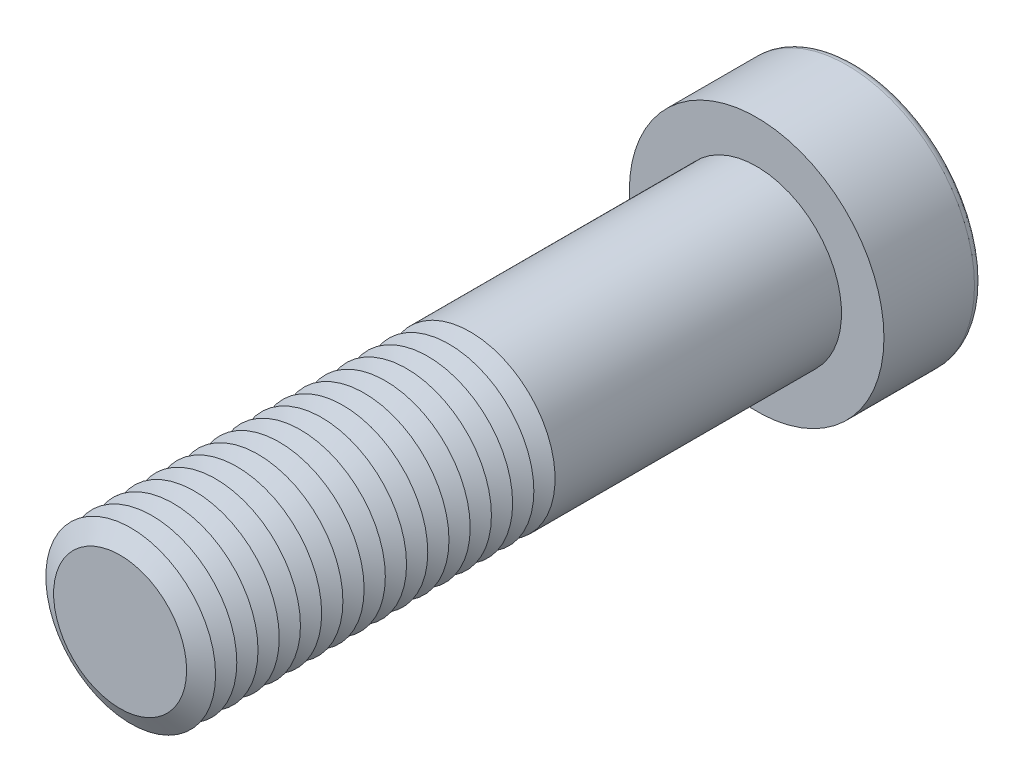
ISO-10303-21;
HEADER;
FILE_DESCRIPTION(('STEP AP214'),'2;1');
FILE_NAME('part.step','',(''),(''),'','','');
FILE_SCHEMA(('AUTOMOTIVE_DESIGN { 1 0 10303 214 1 1 1 1 }'));
ENDSEC;
DATA;
#1=APPLICATION_CONTEXT('core data for automotive mechanical design processes');
#2=APPLICATION_PROTOCOL_DEFINITION('international standard','automotive_design',2000,#1);
#3=PRODUCT_CONTEXT('',#1,'mechanical');
#4=PRODUCT('Part','Part','',(#3));
#5=PRODUCT_RELATED_PRODUCT_CATEGORY('part','',(#4));
#6=PRODUCT_DEFINITION_FORMATION('','',#4);
#7=PRODUCT_DEFINITION_CONTEXT('part definition',#1,'design');
#8=PRODUCT_DEFINITION('design','',#6,#7);
#9=PRODUCT_DEFINITION_SHAPE('','',#8);
#10=(LENGTH_UNIT() NAMED_UNIT(*) SI_UNIT(.MILLI.,.METRE.));
#11=(NAMED_UNIT(*) PLANE_ANGLE_UNIT() SI_UNIT($,.RADIAN.));
#12=(NAMED_UNIT(*) SI_UNIT($,.STERADIAN.) SOLID_ANGLE_UNIT());
#13=UNCERTAINTY_MEASURE_WITH_UNIT(LENGTH_MEASURE(1.E-05),#10,'distance_accuracy_value','');
#14=(GEOMETRIC_REPRESENTATION_CONTEXT(3) GLOBAL_UNCERTAINTY_ASSIGNED_CONTEXT((#13)) GLOBAL_UNIT_ASSIGNED_CONTEXT((#10,
#11,#12)) REPRESENTATION_CONTEXT('',''));
#15=CARTESIAN_POINT('',(0.,0.,0.));
#16=DIRECTION('',(0.,0.,1.));
#17=DIRECTION('',(1.,0.,0.));
#18=AXIS2_PLACEMENT_3D('',#15,#16,#17);
#19=CARTESIAN_POINT('',(0.,0.,79.5));
#20=DIRECTION('',(0.,0.,1.));
#21=DIRECTION('',(1.,0.,0.));
#22=AXIS2_PLACEMENT_3D('',#19,#20,#21);
#23=CONICAL_SURFACE('',#22,12.,1.0471975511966);
#24=CARTESIAN_POINT('',(0.,0.,78.));
#25=DIRECTION('',(0.,0.,1.));
#26=DIRECTION('',(1.,0.,0.));
#27=AXIS2_PLACEMENT_3D('',#24,#25,#26);
#28=CIRCLE('',#27,9.40192378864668);
#29=CARTESIAN_POINT('',(9.40192378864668,0.,78.));
#30=VERTEX_POINT('',#29);
#31=EDGE_CURVE('E313',#30,#30,#28,.T.);
#32=ORIENTED_EDGE('',*,*,#31,.T.);
#33=EDGE_LOOP('',(#32));
#34=FACE_BOUND('',#33,.T.);
#35=CARTESIAN_POINT('',(0.,0.,79.5));
#36=DIRECTION('',(0.,0.,1.));
#37=DIRECTION('',(1.,0.,0.));
#38=AXIS2_PLACEMENT_3D('',#35,#36,#37);
#39=CIRCLE('',#38,12.);
#40=CARTESIAN_POINT('',(12.,0.,79.5));
#41=VERTEX_POINT('',#40);
#42=EDGE_CURVE('E316',#41,#41,#39,.T.);
#43=ORIENTED_EDGE('',*,*,#42,.F.);
#44=EDGE_LOOP('',(#43));
#45=FACE_BOUND('',#44,.T.);
#46=ADVANCED_FACE('F39',(#34,#45),#23,.T.);
#47=CARTESIAN_POINT('',(0.,0.,78.));
#48=DIRECTION('',(0.,0.,-1.));
#49=DIRECTION('',(-1.,0.,0.));
#50=AXIS2_PLACEMENT_3D('',#47,#48,#49);
#51=CONICAL_SURFACE('',#50,9.40192378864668,1.0471975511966);
#52=CARTESIAN_POINT('',(0.,0.,76.5));
#53=DIRECTION('',(0.,0.,1.));
#54=DIRECTION('',(1.,0.,0.));
#55=AXIS2_PLACEMENT_3D('',#52,#53,#54);
#56=CIRCLE('',#55,12.);
#57=CARTESIAN_POINT('',(12.,0.,76.5));
#58=VERTEX_POINT('',#57);
#59=EDGE_CURVE('E324',#58,#58,#56,.T.);
#60=ORIENTED_EDGE('',*,*,#59,.T.);
#61=EDGE_LOOP('',(#60));
#62=FACE_BOUND('',#61,.T.);
#63=ORIENTED_EDGE('',*,*,#31,.F.);
#64=EDGE_LOOP('',(#63));
#65=FACE_BOUND('',#64,.T.);
#66=ADVANCED_FACE('F244',(#62,#65),#51,.T.);
#67=CARTESIAN_POINT('',(0.,0.,90.));
#68=DIRECTION('',(0.,0.,1.));
#69=DIRECTION('',(1.,0.,0.));
#70=AXIS2_PLACEMENT_3D('',#67,#68,#69);
#71=PLANE('',#70);
#72=CARTESIAN_POINT('',(0.,0.,90.));
#73=DIRECTION('',(0.,0.,1.));
#74=DIRECTION('',(1.,0.,0.));
#75=AXIS2_PLACEMENT_3D('',#72,#73,#74);
#76=CIRCLE('',#75,9.40192378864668);
#77=CARTESIAN_POINT('',(9.40192378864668,0.,90.));
#78=VERTEX_POINT('',#77);
#79=EDGE_CURVE('E173',#78,#78,#76,.T.);
#80=ORIENTED_EDGE('',*,*,#79,.T.);
#81=EDGE_LOOP('',(#80));
#82=FACE_BOUND('',#81,.T.);
#83=ADVANCED_FACE('F250',(#82),#71,.T.);
#84=CARTESIAN_POINT('',(0.,0.,90.));
#85=DIRECTION('',(0.,0.,-1.));
#86=DIRECTION('',(-1.,0.,0.));
#87=AXIS2_PLACEMENT_3D('',#84,#85,#86);
#88=CONICAL_SURFACE('',#87,9.40192378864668,1.0471975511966);
#89=CARTESIAN_POINT('',(0.,0.,88.5));
#90=DIRECTION('',(0.,0.,1.));
#91=DIRECTION('',(1.,0.,0.));
#92=AXIS2_PLACEMENT_3D('',#89,#90,#91);
#93=CIRCLE('',#92,12.);
#94=CARTESIAN_POINT('',(12.,0.,88.5));
#95=VERTEX_POINT('',#94);
#96=EDGE_CURVE('E290',#95,#95,#93,.T.);
#97=ORIENTED_EDGE('',*,*,#96,.T.);
#98=EDGE_LOOP('',(#97));
#99=FACE_BOUND('',#98,.T.);
#100=ORIENTED_EDGE('',*,*,#79,.F.);
#101=EDGE_LOOP('',(#100));
#102=FACE_BOUND('',#101,.T.);
#103=ADVANCED_FACE('F198',(#99,#102),#88,.T.);
#104=CARTESIAN_POINT('',(0.,0.,88.5));
#105=DIRECTION('',(0.,0.,1.));
#106=DIRECTION('',(1.,0.,0.));
#107=AXIS2_PLACEMENT_3D('',#104,#105,#106);
#108=CONICAL_SURFACE('',#107,12.,1.0471975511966);
#109=CARTESIAN_POINT('',(0.,0.,87.));
#110=DIRECTION('',(0.,0.,1.));
#111=DIRECTION('',(1.,0.,0.));
#112=AXIS2_PLACEMENT_3D('',#109,#110,#111);
#113=CIRCLE('',#112,9.40192378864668);
#114=CARTESIAN_POINT('',(9.40192378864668,0.,87.));
#115=VERTEX_POINT('',#114);
#116=EDGE_CURVE('E287',#115,#115,#113,.T.);
#117=ORIENTED_EDGE('',*,*,#116,.T.);
#118=EDGE_LOOP('',(#117));
#119=FACE_BOUND('',#118,.T.);
#120=ORIENTED_EDGE('',*,*,#96,.F.);
#121=EDGE_LOOP('',(#120));
#122=FACE_BOUND('',#121,.T.);
#123=ADVANCED_FACE('F276',(#119,#122),#108,.T.);
#124=CARTESIAN_POINT('',(0.,0.,87.));
#125=DIRECTION('',(0.,0.,-1.));
#126=DIRECTION('',(-1.,0.,0.));
#127=AXIS2_PLACEMENT_3D('',#124,#125,#126);
#128=CONICAL_SURFACE('',#127,9.40192378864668,1.0471975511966);
#129=CARTESIAN_POINT('',(0.,0.,85.5));
#130=DIRECTION('',(0.,0.,1.));
#131=DIRECTION('',(1.,0.,0.));
#132=AXIS2_PLACEMENT_3D('',#129,#130,#131);
#133=CIRCLE('',#132,12.);
#134=CARTESIAN_POINT('',(12.,0.,85.5));
#135=VERTEX_POINT('',#134);
#136=EDGE_CURVE('E299',#135,#135,#133,.T.);
#137=ORIENTED_EDGE('',*,*,#136,.T.);
#138=EDGE_LOOP('',(#137));
#139=FACE_BOUND('',#138,.T.);
#140=ORIENTED_EDGE('',*,*,#116,.F.);
#141=EDGE_LOOP('',(#140));
#142=FACE_BOUND('',#141,.T.);
#143=ADVANCED_FACE('F273',(#139,#142),#128,.T.);
#144=CARTESIAN_POINT('',(0.,0.,85.5));
#145=DIRECTION('',(0.,0.,1.));
#146=DIRECTION('',(1.,0.,0.));
#147=AXIS2_PLACEMENT_3D('',#144,#145,#146);
#148=CONICAL_SURFACE('',#147,12.,1.0471975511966);
#149=CARTESIAN_POINT('',(0.,0.,84.));
#150=DIRECTION('',(0.,0.,1.));
#151=DIRECTION('',(1.,0.,0.));
#152=AXIS2_PLACEMENT_3D('',#149,#150,#151);
#153=CIRCLE('',#152,9.40192378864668);
#154=CARTESIAN_POINT('',(9.40192378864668,0.,84.));
#155=VERTEX_POINT('',#154);
#156=EDGE_CURVE('E292',#155,#155,#153,.T.);
#157=ORIENTED_EDGE('',*,*,#156,.T.);
#158=EDGE_LOOP('',(#157));
#159=FACE_BOUND('',#158,.T.);
#160=ORIENTED_EDGE('',*,*,#136,.F.);
#161=EDGE_LOOP('',(#160));
#162=FACE_BOUND('',#161,.T.);
#163=ADVANCED_FACE('F269',(#159,#162),#148,.T.);
#164=CARTESIAN_POINT('',(0.,0.,84.));
#165=DIRECTION('',(0.,0.,-1.));
#166=DIRECTION('',(-1.,0.,0.));
#167=AXIS2_PLACEMENT_3D('',#164,#165,#166);
#168=CONICAL_SURFACE('',#167,9.40192378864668,1.0471975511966);
#169=CARTESIAN_POINT('',(0.,0.,82.5));
#170=DIRECTION('',(0.,0.,1.));
#171=DIRECTION('',(1.,0.,0.));
#172=AXIS2_PLACEMENT_3D('',#169,#170,#171);
#173=CIRCLE('',#172,12.);
#174=CARTESIAN_POINT('',(12.,0.,82.5));
#175=VERTEX_POINT('',#174);
#176=EDGE_CURVE('E309',#175,#175,#173,.T.);
#177=ORIENTED_EDGE('',*,*,#176,.T.);
#178=EDGE_LOOP('',(#177));
#179=FACE_BOUND('',#178,.T.);
#180=ORIENTED_EDGE('',*,*,#156,.F.);
#181=EDGE_LOOP('',(#180));
#182=FACE_BOUND('',#181,.T.);
#183=ADVANCED_FACE('F265',(#179,#182),#168,.T.);
#184=CARTESIAN_POINT('',(0.,0.,82.5));
#185=DIRECTION('',(0.,0.,1.));
#186=DIRECTION('',(1.,0.,0.));
#187=AXIS2_PLACEMENT_3D('',#184,#185,#186);
#188=CONICAL_SURFACE('',#187,12.,1.0471975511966);
#189=CARTESIAN_POINT('',(0.,0.,81.));
#190=DIRECTION('',(0.,0.,1.));
#191=DIRECTION('',(1.,0.,0.));
#192=AXIS2_PLACEMENT_3D('',#189,#190,#191);
#193=CIRCLE('',#192,9.40192378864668);
#194=CARTESIAN_POINT('',(9.40192378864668,0.,81.));
#195=VERTEX_POINT('',#194);
#196=EDGE_CURVE('E305',#195,#195,#193,.T.);
#197=ORIENTED_EDGE('',*,*,#196,.T.);
#198=EDGE_LOOP('',(#197));
#199=FACE_BOUND('',#198,.T.);
#200=ORIENTED_EDGE('',*,*,#176,.F.);
#201=EDGE_LOOP('',(#200));
#202=FACE_BOUND('',#201,.T.);
#203=ADVANCED_FACE('F261',(#199,#202),#188,.T.);
#204=CARTESIAN_POINT('',(0.,0.,81.));
#205=DIRECTION('',(0.,0.,-1.));
#206=DIRECTION('',(-1.,0.,0.));
#207=AXIS2_PLACEMENT_3D('',#204,#205,#206);
#208=CONICAL_SURFACE('',#207,9.40192378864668,1.0471975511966);
#209=ORIENTED_EDGE('',*,*,#42,.T.);
#210=EDGE_LOOP('',(#209));
#211=FACE_BOUND('',#210,.T.);
#212=ORIENTED_EDGE('',*,*,#196,.F.);
#213=EDGE_LOOP('',(#212));
#214=FACE_BOUND('',#213,.T.);
#215=ADVANCED_FACE('F257',(#211,#214),#208,.T.);
#216=CARTESIAN_POINT('',(0.,0.,76.5));
#217=DIRECTION('',(0.,0.,1.));
#218=DIRECTION('',(1.,0.,0.));
#219=AXIS2_PLACEMENT_3D('',#216,#217,#218);
#220=CONICAL_SURFACE('',#219,12.,1.0471975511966);
#221=CARTESIAN_POINT('',(0.,0.,75.));
#222=DIRECTION('',(0.,0.,1.));
#223=DIRECTION('',(1.,0.,0.));
#224=AXIS2_PLACEMENT_3D('',#221,#222,#223);
#225=CIRCLE('',#224,9.40192378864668);
#226=CARTESIAN_POINT('',(9.40192378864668,0.,75.));
#227=VERTEX_POINT('',#226);
#228=EDGE_CURVE('E320',#227,#227,#225,.T.);
#229=ORIENTED_EDGE('',*,*,#228,.T.);
#230=EDGE_LOOP('',(#229));
#231=FACE_BOUND('',#230,.T.);
#232=ORIENTED_EDGE('',*,*,#59,.F.);
#233=EDGE_LOOP('',(#232));
#234=FACE_BOUND('',#233,.T.);
#235=ADVANCED_FACE('F260',(#231,#234),#220,.T.);
#236=CARTESIAN_POINT('',(0.,0.,75.));
#237=DIRECTION('',(0.,0.,-1.));
#238=DIRECTION('',(-1.,0.,0.));
#239=AXIS2_PLACEMENT_3D('',#236,#237,#238);
#240=CONICAL_SURFACE('',#239,9.40192378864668,1.0471975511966);
#241=CARTESIAN_POINT('',(0.,0.,73.5));
#242=DIRECTION('',(0.,0.,1.));
#243=DIRECTION('',(1.,0.,0.));
#244=AXIS2_PLACEMENT_3D('',#241,#242,#243);
#245=CIRCLE('',#244,12.);
#246=CARTESIAN_POINT('',(12.,0.,73.5));
#247=VERTEX_POINT('',#246);
#248=EDGE_CURVE('E332',#247,#247,#245,.T.);
#249=ORIENTED_EDGE('',*,*,#248,.T.);
#250=EDGE_LOOP('',(#249));
#251=FACE_BOUND('',#250,.T.);
#252=ORIENTED_EDGE('',*,*,#228,.F.);
#253=EDGE_LOOP('',(#252));
#254=FACE_BOUND('',#253,.T.);
#255=ADVANCED_FACE('F511',(#251,#254),#240,.T.);
#256=CARTESIAN_POINT('',(0.,0.,73.5));
#257=DIRECTION('',(0.,0.,1.));
#258=DIRECTION('',(1.,0.,0.));
#259=AXIS2_PLACEMENT_3D('',#256,#257,#258);
#260=CONICAL_SURFACE('',#259,12.,1.0471975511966);
#261=CARTESIAN_POINT('',(0.,0.,72.));
#262=DIRECTION('',(0.,0.,1.));
#263=DIRECTION('',(1.,0.,0.));
#264=AXIS2_PLACEMENT_3D('',#261,#262,#263);
#265=CIRCLE('',#264,9.40192378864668);
#266=CARTESIAN_POINT('',(9.40192378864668,0.,72.));
#267=VERTEX_POINT('',#266);
#268=EDGE_CURVE('E328',#267,#267,#265,.T.);
#269=ORIENTED_EDGE('',*,*,#268,.T.);
#270=EDGE_LOOP('',(#269));
#271=FACE_BOUND('',#270,.T.);
#272=ORIENTED_EDGE('',*,*,#248,.F.);
#273=EDGE_LOOP('',(#272));
#274=FACE_BOUND('',#273,.T.);
#275=ADVANCED_FACE('F507',(#271,#274),#260,.T.);
#276=CARTESIAN_POINT('',(0.,0.,72.));
#277=DIRECTION('',(0.,0.,-1.));
#278=DIRECTION('',(-1.,0.,0.));
#279=AXIS2_PLACEMENT_3D('',#276,#277,#278);
#280=CONICAL_SURFACE('',#279,9.40192378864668,1.0471975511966);
#281=CARTESIAN_POINT('',(0.,0.,70.5));
#282=DIRECTION('',(0.,0.,1.));
#283=DIRECTION('',(1.,0.,0.));
#284=AXIS2_PLACEMENT_3D('',#281,#282,#283);
#285=CIRCLE('',#284,12.);
#286=CARTESIAN_POINT('',(12.,0.,70.5));
#287=VERTEX_POINT('',#286);
#288=EDGE_CURVE('E340',#287,#287,#285,.T.);
#289=ORIENTED_EDGE('',*,*,#288,.T.);
#290=EDGE_LOOP('',(#289));
#291=FACE_BOUND('',#290,.T.);
#292=ORIENTED_EDGE('',*,*,#268,.F.);
#293=EDGE_LOOP('',(#292));
#294=FACE_BOUND('',#293,.T.);
#295=ADVANCED_FACE('F503',(#291,#294),#280,.T.);
#296=CARTESIAN_POINT('',(0.,0.,70.5));
#297=DIRECTION('',(0.,0.,1.));
#298=DIRECTION('',(1.,0.,0.));
#299=AXIS2_PLACEMENT_3D('',#296,#297,#298);
#300=CONICAL_SURFACE('',#299,12.,1.0471975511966);
#301=CARTESIAN_POINT('',(0.,0.,69.));
#302=DIRECTION('',(0.,0.,1.));
#303=DIRECTION('',(1.,0.,0.));
#304=AXIS2_PLACEMENT_3D('',#301,#302,#303);
#305=CIRCLE('',#304,9.40192378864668);
#306=CARTESIAN_POINT('',(9.40192378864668,0.,69.));
#307=VERTEX_POINT('',#306);
#308=EDGE_CURVE('E336',#307,#307,#305,.T.);
#309=ORIENTED_EDGE('',*,*,#308,.T.);
#310=EDGE_LOOP('',(#309));
#311=FACE_BOUND('',#310,.T.);
#312=ORIENTED_EDGE('',*,*,#288,.F.);
#313=EDGE_LOOP('',(#312));
#314=FACE_BOUND('',#313,.T.);
#315=ADVANCED_FACE('F499',(#311,#314),#300,.T.);
#316=CARTESIAN_POINT('',(0.,0.,69.));
#317=DIRECTION('',(0.,0.,-1.));
#318=DIRECTION('',(-1.,0.,0.));
#319=AXIS2_PLACEMENT_3D('',#316,#317,#318);
#320=CONICAL_SURFACE('',#319,9.40192378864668,1.0471975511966);
#321=CARTESIAN_POINT('',(0.,0.,67.5));
#322=DIRECTION('',(0.,0.,1.));
#323=DIRECTION('',(1.,0.,0.));
#324=AXIS2_PLACEMENT_3D('',#321,#322,#323);
#325=CIRCLE('',#324,12.);
#326=CARTESIAN_POINT('',(12.,0.,67.5));
#327=VERTEX_POINT('',#326);
#328=EDGE_CURVE('E348',#327,#327,#325,.T.);
#329=ORIENTED_EDGE('',*,*,#328,.T.);
#330=EDGE_LOOP('',(#329));
#331=FACE_BOUND('',#330,.T.);
#332=ORIENTED_EDGE('',*,*,#308,.F.);
#333=EDGE_LOOP('',(#332));
#334=FACE_BOUND('',#333,.T.);
#335=ADVANCED_FACE('F495',(#331,#334),#320,.T.);
#336=CARTESIAN_POINT('',(0.,0.,67.5));
#337=DIRECTION('',(0.,0.,1.));
#338=DIRECTION('',(1.,0.,0.));
#339=AXIS2_PLACEMENT_3D('',#336,#337,#338);
#340=CONICAL_SURFACE('',#339,12.,1.0471975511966);
#341=CARTESIAN_POINT('',(0.,0.,66.));
#342=DIRECTION('',(0.,0.,1.));
#343=DIRECTION('',(1.,0.,0.));
#344=AXIS2_PLACEMENT_3D('',#341,#342,#343);
#345=CIRCLE('',#344,9.40192378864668);
#346=CARTESIAN_POINT('',(9.40192378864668,0.,66.));
#347=VERTEX_POINT('',#346);
#348=EDGE_CURVE('E344',#347,#347,#345,.T.);
#349=ORIENTED_EDGE('',*,*,#348,.T.);
#350=EDGE_LOOP('',(#349));
#351=FACE_BOUND('',#350,.T.);
#352=ORIENTED_EDGE('',*,*,#328,.F.);
#353=EDGE_LOOP('',(#352));
#354=FACE_BOUND('',#353,.T.);
#355=ADVANCED_FACE('F491',(#351,#354),#340,.T.);
#356=CARTESIAN_POINT('',(0.,0.,66.));
#357=DIRECTION('',(0.,0.,-1.));
#358=DIRECTION('',(-1.,0.,0.));
#359=AXIS2_PLACEMENT_3D('',#356,#357,#358);
#360=CONICAL_SURFACE('',#359,9.40192378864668,1.0471975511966);
#361=CARTESIAN_POINT('',(0.,0.,64.5));
#362=DIRECTION('',(0.,0.,1.));
#363=DIRECTION('',(1.,0.,0.));
#364=AXIS2_PLACEMENT_3D('',#361,#362,#363);
#365=CIRCLE('',#364,12.);
#366=CARTESIAN_POINT('',(12.,0.,64.5));
#367=VERTEX_POINT('',#366);
#368=EDGE_CURVE('E356',#367,#367,#365,.T.);
#369=ORIENTED_EDGE('',*,*,#368,.T.);
#370=EDGE_LOOP('',(#369));
#371=FACE_BOUND('',#370,.T.);
#372=ORIENTED_EDGE('',*,*,#348,.F.);
#373=EDGE_LOOP('',(#372));
#374=FACE_BOUND('',#373,.T.);
#375=ADVANCED_FACE('F487',(#371,#374),#360,.T.);
#376=CARTESIAN_POINT('',(0.,0.,64.5));
#377=DIRECTION('',(0.,0.,1.));
#378=DIRECTION('',(1.,0.,0.));
#379=AXIS2_PLACEMENT_3D('',#376,#377,#378);
#380=CONICAL_SURFACE('',#379,12.,1.0471975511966);
#381=CARTESIAN_POINT('',(0.,0.,63.));
#382=DIRECTION('',(0.,0.,1.));
#383=DIRECTION('',(1.,0.,0.));
#384=AXIS2_PLACEMENT_3D('',#381,#382,#383);
#385=CIRCLE('',#384,9.40192378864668);
#386=CARTESIAN_POINT('',(9.40192378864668,0.,63.));
#387=VERTEX_POINT('',#386);
#388=EDGE_CURVE('E352',#387,#387,#385,.T.);
#389=ORIENTED_EDGE('',*,*,#388,.T.);
#390=EDGE_LOOP('',(#389));
#391=FACE_BOUND('',#390,.T.);
#392=ORIENTED_EDGE('',*,*,#368,.F.);
#393=EDGE_LOOP('',(#392));
#394=FACE_BOUND('',#393,.T.);
#395=ADVANCED_FACE('F483',(#391,#394),#380,.T.);
#396=CARTESIAN_POINT('',(0.,0.,63.));
#397=DIRECTION('',(0.,0.,-1.));
#398=DIRECTION('',(-1.,0.,0.));
#399=AXIS2_PLACEMENT_3D('',#396,#397,#398);
#400=CONICAL_SURFACE('',#399,9.40192378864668,1.0471975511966);
#401=CARTESIAN_POINT('',(0.,0.,61.5));
#402=DIRECTION('',(0.,0.,1.));
#403=DIRECTION('',(1.,0.,0.));
#404=AXIS2_PLACEMENT_3D('',#401,#402,#403);
#405=CIRCLE('',#404,12.);
#406=CARTESIAN_POINT('',(12.,0.,61.5));
#407=VERTEX_POINT('',#406);
#408=EDGE_CURVE('E364',#407,#407,#405,.T.);
#409=ORIENTED_EDGE('',*,*,#408,.T.);
#410=EDGE_LOOP('',(#409));
#411=FACE_BOUND('',#410,.T.);
#412=ORIENTED_EDGE('',*,*,#388,.F.);
#413=EDGE_LOOP('',(#412));
#414=FACE_BOUND('',#413,.T.);
#415=ADVANCED_FACE('F479',(#411,#414),#400,.T.);
#416=CARTESIAN_POINT('',(0.,0.,61.5));
#417=DIRECTION('',(0.,0.,1.));
#418=DIRECTION('',(1.,0.,0.));
#419=AXIS2_PLACEMENT_3D('',#416,#417,#418);
#420=CONICAL_SURFACE('',#419,12.,1.0471975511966);
#421=CARTESIAN_POINT('',(0.,0.,60.));
#422=DIRECTION('',(0.,0.,1.));
#423=DIRECTION('',(1.,0.,0.));
#424=AXIS2_PLACEMENT_3D('',#421,#422,#423);
#425=CIRCLE('',#424,9.40192378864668);
#426=CARTESIAN_POINT('',(9.40192378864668,0.,60.));
#427=VERTEX_POINT('',#426);
#428=EDGE_CURVE('E360',#427,#427,#425,.T.);
#429=ORIENTED_EDGE('',*,*,#428,.T.);
#430=EDGE_LOOP('',(#429));
#431=FACE_BOUND('',#430,.T.);
#432=ORIENTED_EDGE('',*,*,#408,.F.);
#433=EDGE_LOOP('',(#432));
#434=FACE_BOUND('',#433,.T.);
#435=ADVANCED_FACE('F475',(#431,#434),#420,.T.);
#436=CARTESIAN_POINT('',(0.,0.,60.));
#437=DIRECTION('',(0.,0.,-1.));
#438=DIRECTION('',(-1.,0.,0.));
#439=AXIS2_PLACEMENT_3D('',#436,#437,#438);
#440=CONICAL_SURFACE('',#439,9.40192378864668,1.0471975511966);
#441=CARTESIAN_POINT('',(0.,0.,58.5));
#442=DIRECTION('',(0.,0.,1.));
#443=DIRECTION('',(1.,0.,0.));
#444=AXIS2_PLACEMENT_3D('',#441,#442,#443);
#445=CIRCLE('',#444,12.);
#446=CARTESIAN_POINT('',(12.,0.,58.5));
#447=VERTEX_POINT('',#446);
#448=EDGE_CURVE('E372',#447,#447,#445,.T.);
#449=ORIENTED_EDGE('',*,*,#448,.T.);
#450=EDGE_LOOP('',(#449));
#451=FACE_BOUND('',#450,.T.);
#452=ORIENTED_EDGE('',*,*,#428,.F.);
#453=EDGE_LOOP('',(#452));
#454=FACE_BOUND('',#453,.T.);
#455=ADVANCED_FACE('F471',(#451,#454),#440,.T.);
#456=CARTESIAN_POINT('',(0.,0.,58.5));
#457=DIRECTION('',(0.,0.,1.));
#458=DIRECTION('',(1.,0.,0.));
#459=AXIS2_PLACEMENT_3D('',#456,#457,#458);
#460=CONICAL_SURFACE('',#459,12.,1.0471975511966);
#461=CARTESIAN_POINT('',(0.,0.,57.));
#462=DIRECTION('',(0.,0.,1.));
#463=DIRECTION('',(1.,0.,0.));
#464=AXIS2_PLACEMENT_3D('',#461,#462,#463);
#465=CIRCLE('',#464,9.40192378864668);
#466=CARTESIAN_POINT('',(9.40192378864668,0.,57.));
#467=VERTEX_POINT('',#466);
#468=EDGE_CURVE('E368',#467,#467,#465,.T.);
#469=ORIENTED_EDGE('',*,*,#468,.T.);
#470=EDGE_LOOP('',(#469));
#471=FACE_BOUND('',#470,.T.);
#472=ORIENTED_EDGE('',*,*,#448,.F.);
#473=EDGE_LOOP('',(#472));
#474=FACE_BOUND('',#473,.T.);
#475=ADVANCED_FACE('F467',(#471,#474),#460,.T.);
#476=CARTESIAN_POINT('',(0.,0.,57.));
#477=DIRECTION('',(0.,0.,-1.));
#478=DIRECTION('',(-1.,0.,0.));
#479=AXIS2_PLACEMENT_3D('',#476,#477,#478);
#480=CONICAL_SURFACE('',#479,9.40192378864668,1.0471975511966);
#481=CARTESIAN_POINT('',(0.,0.,55.5));
#482=DIRECTION('',(0.,0.,1.));
#483=DIRECTION('',(1.,0.,0.));
#484=AXIS2_PLACEMENT_3D('',#481,#482,#483);
#485=CIRCLE('',#484,12.);
#486=CARTESIAN_POINT('',(12.,0.,55.5));
#487=VERTEX_POINT('',#486);
#488=EDGE_CURVE('E380',#487,#487,#485,.T.);
#489=ORIENTED_EDGE('',*,*,#488,.T.);
#490=EDGE_LOOP('',(#489));
#491=FACE_BOUND('',#490,.T.);
#492=ORIENTED_EDGE('',*,*,#468,.F.);
#493=EDGE_LOOP('',(#492));
#494=FACE_BOUND('',#493,.T.);
#495=ADVANCED_FACE('F463',(#491,#494),#480,.T.);
#496=CARTESIAN_POINT('',(0.,0.,55.5));
#497=DIRECTION('',(0.,0.,1.));
#498=DIRECTION('',(1.,0.,0.));
#499=AXIS2_PLACEMENT_3D('',#496,#497,#498);
#500=CONICAL_SURFACE('',#499,12.,1.0471975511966);
#501=CARTESIAN_POINT('',(0.,0.,54.));
#502=DIRECTION('',(0.,0.,1.));
#503=DIRECTION('',(1.,0.,0.));
#504=AXIS2_PLACEMENT_3D('',#501,#502,#503);
#505=CIRCLE('',#504,9.40192378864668);
#506=CARTESIAN_POINT('',(9.40192378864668,0.,54.));
#507=VERTEX_POINT('',#506);
#508=EDGE_CURVE('E376',#507,#507,#505,.T.);
#509=ORIENTED_EDGE('',*,*,#508,.T.);
#510=EDGE_LOOP('',(#509));
#511=FACE_BOUND('',#510,.T.);
#512=ORIENTED_EDGE('',*,*,#488,.F.);
#513=EDGE_LOOP('',(#512));
#514=FACE_BOUND('',#513,.T.);
#515=ADVANCED_FACE('F459',(#511,#514),#500,.T.);
#516=CARTESIAN_POINT('',(0.,0.,54.));
#517=DIRECTION('',(0.,0.,-1.));
#518=DIRECTION('',(-1.,0.,0.));
#519=AXIS2_PLACEMENT_3D('',#516,#517,#518);
#520=CONICAL_SURFACE('',#519,9.40192378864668,1.0471975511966);
#521=CARTESIAN_POINT('',(0.,0.,52.5));
#522=DIRECTION('',(0.,0.,1.));
#523=DIRECTION('',(1.,0.,0.));
#524=AXIS2_PLACEMENT_3D('',#521,#522,#523);
#525=CIRCLE('',#524,12.);
#526=CARTESIAN_POINT('',(12.,0.,52.5));
#527=VERTEX_POINT('',#526);
#528=EDGE_CURVE('E388',#527,#527,#525,.T.);
#529=ORIENTED_EDGE('',*,*,#528,.T.);
#530=EDGE_LOOP('',(#529));
#531=FACE_BOUND('',#530,.T.);
#532=ORIENTED_EDGE('',*,*,#508,.F.);
#533=EDGE_LOOP('',(#532));
#534=FACE_BOUND('',#533,.T.);
#535=ADVANCED_FACE('F455',(#531,#534),#520,.T.);
#536=CARTESIAN_POINT('',(0.,0.,52.5));
#537=DIRECTION('',(0.,0.,1.));
#538=DIRECTION('',(1.,0.,0.));
#539=AXIS2_PLACEMENT_3D('',#536,#537,#538);
#540=CONICAL_SURFACE('',#539,12.,1.0471975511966);
#541=CARTESIAN_POINT('',(0.,0.,51.));
#542=DIRECTION('',(0.,0.,1.));
#543=DIRECTION('',(1.,0.,0.));
#544=AXIS2_PLACEMENT_3D('',#541,#542,#543);
#545=CIRCLE('',#544,9.40192378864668);
#546=CARTESIAN_POINT('',(9.40192378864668,0.,51.));
#547=VERTEX_POINT('',#546);
#548=EDGE_CURVE('E384',#547,#547,#545,.T.);
#549=ORIENTED_EDGE('',*,*,#548,.T.);
#550=EDGE_LOOP('',(#549));
#551=FACE_BOUND('',#550,.T.);
#552=ORIENTED_EDGE('',*,*,#528,.F.);
#553=EDGE_LOOP('',(#552));
#554=FACE_BOUND('',#553,.T.);
#555=ADVANCED_FACE('F451',(#551,#554),#540,.T.);
#556=CARTESIAN_POINT('',(0.,0.,51.));
#557=DIRECTION('',(0.,0.,-1.));
#558=DIRECTION('',(-1.,0.,0.));
#559=AXIS2_PLACEMENT_3D('',#556,#557,#558);
#560=CONICAL_SURFACE('',#559,9.40192378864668,1.0471975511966);
#561=CARTESIAN_POINT('',(0.,0.,49.5));
#562=DIRECTION('',(0.,0.,1.));
#563=DIRECTION('',(1.,0.,0.));
#564=AXIS2_PLACEMENT_3D('',#561,#562,#563);
#565=CIRCLE('',#564,12.);
#566=CARTESIAN_POINT('',(12.,0.,49.5));
#567=VERTEX_POINT('',#566);
#568=EDGE_CURVE('E396',#567,#567,#565,.T.);
#569=ORIENTED_EDGE('',*,*,#568,.T.);
#570=EDGE_LOOP('',(#569));
#571=FACE_BOUND('',#570,.T.);
#572=ORIENTED_EDGE('',*,*,#548,.F.);
#573=EDGE_LOOP('',(#572));
#574=FACE_BOUND('',#573,.T.);
#575=ADVANCED_FACE('F447',(#571,#574),#560,.T.);
#576=CARTESIAN_POINT('',(0.,0.,49.5));
#577=DIRECTION('',(0.,0.,1.));
#578=DIRECTION('',(1.,0.,0.));
#579=AXIS2_PLACEMENT_3D('',#576,#577,#578);
#580=CONICAL_SURFACE('',#579,12.,1.0471975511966);
#581=CARTESIAN_POINT('',(0.,0.,48.));
#582=DIRECTION('',(0.,0.,1.));
#583=DIRECTION('',(1.,0.,0.));
#584=AXIS2_PLACEMENT_3D('',#581,#582,#583);
#585=CIRCLE('',#584,9.40192378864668);
#586=CARTESIAN_POINT('',(9.40192378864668,0.,48.));
#587=VERTEX_POINT('',#586);
#588=EDGE_CURVE('E392',#587,#587,#585,.T.);
#589=ORIENTED_EDGE('',*,*,#588,.T.);
#590=EDGE_LOOP('',(#589));
#591=FACE_BOUND('',#590,.T.);
#592=ORIENTED_EDGE('',*,*,#568,.F.);
#593=EDGE_LOOP('',(#592));
#594=FACE_BOUND('',#593,.T.);
#595=ADVANCED_FACE('F443',(#591,#594),#580,.T.);
#596=CARTESIAN_POINT('',(0.,0.,48.));
#597=DIRECTION('',(0.,0.,-1.));
#598=DIRECTION('',(-1.,0.,0.));
#599=AXIS2_PLACEMENT_3D('',#596,#597,#598);
#600=CONICAL_SURFACE('',#599,9.40192378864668,1.0471975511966);
#601=CARTESIAN_POINT('',(0.,0.,46.5));
#602=DIRECTION('',(0.,0.,1.));
#603=DIRECTION('',(1.,0.,0.));
#604=AXIS2_PLACEMENT_3D('',#601,#602,#603);
#605=CIRCLE('',#604,12.);
#606=CARTESIAN_POINT('',(12.,0.,46.5));
#607=VERTEX_POINT('',#606);
#608=EDGE_CURVE('E403',#607,#607,#605,.T.);
#609=ORIENTED_EDGE('',*,*,#608,.T.);
#610=EDGE_LOOP('',(#609));
#611=FACE_BOUND('',#610,.T.);
#612=ORIENTED_EDGE('',*,*,#588,.F.);
#613=EDGE_LOOP('',(#612));
#614=FACE_BOUND('',#613,.T.);
#615=ADVANCED_FACE('F439',(#611,#614),#600,.T.);
#616=CARTESIAN_POINT('',(0.,0.,46.5));
#617=DIRECTION('',(0.,0.,1.));
#618=DIRECTION('',(1.,0.,0.));
#619=AXIS2_PLACEMENT_3D('',#616,#617,#618);
#620=CONICAL_SURFACE('',#619,12.,1.0471975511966);
#621=CARTESIAN_POINT('',(0.,0.,45.));
#622=DIRECTION('',(0.,0.,1.));
#623=DIRECTION('',(1.,0.,0.));
#624=AXIS2_PLACEMENT_3D('',#621,#622,#623);
#625=CIRCLE('',#624,9.40192378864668);
#626=CARTESIAN_POINT('',(9.40192378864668,0.,45.));
#627=VERTEX_POINT('',#626);
#628=EDGE_CURVE('E399',#627,#627,#625,.T.);
#629=ORIENTED_EDGE('',*,*,#628,.T.);
#630=EDGE_LOOP('',(#629));
#631=FACE_BOUND('',#630,.T.);
#632=ORIENTED_EDGE('',*,*,#608,.F.);
#633=EDGE_LOOP('',(#632));
#634=FACE_BOUND('',#633,.T.);
#635=ADVANCED_FACE('F434',(#631,#634),#620,.T.);
#636=CARTESIAN_POINT('',(0.,0.,45.));
#637=DIRECTION('',(0.,0.,-1.));
#638=DIRECTION('',(-1.,0.,0.));
#639=AXIS2_PLACEMENT_3D('',#636,#637,#638);
#640=CONICAL_SURFACE('',#639,9.40192378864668,1.0471975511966);
#641=CARTESIAN_POINT('',(0.,0.,43.5));
#642=DIRECTION('',(0.,0.,1.));
#643=DIRECTION('',(1.,0.,0.));
#644=AXIS2_PLACEMENT_3D('',#641,#642,#643);
#645=CIRCLE('',#644,12.);
#646=CARTESIAN_POINT('',(12.,0.,43.5));
#647=VERTEX_POINT('',#646);
#648=EDGE_CURVE('E415',#647,#647,#645,.T.);
#649=ORIENTED_EDGE('',*,*,#648,.T.);
#650=EDGE_LOOP('',(#649));
#651=FACE_BOUND('',#650,.T.);
#652=ORIENTED_EDGE('',*,*,#628,.F.);
#653=EDGE_LOOP('',(#652));
#654=FACE_BOUND('',#653,.T.);
#655=ADVANCED_FACE('F420',(#651,#654),#640,.T.);
#656=CARTESIAN_POINT('',(0.,0.,43.5));
#657=DIRECTION('',(0.,0.,1.));
#658=DIRECTION('',(1.,0.,0.));
#659=AXIS2_PLACEMENT_3D('',#656,#657,#658);
#660=CONICAL_SURFACE('',#659,12.,1.0471975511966);
#661=CARTESIAN_POINT('',(0.,0.,42.));
#662=DIRECTION('',(0.,0.,1.));
#663=DIRECTION('',(1.,0.,0.));
#664=AXIS2_PLACEMENT_3D('',#661,#662,#663);
#665=CIRCLE('',#664,9.40192378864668);
#666=CARTESIAN_POINT('',(9.40192378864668,0.,42.));
#667=VERTEX_POINT('',#666);
#668=EDGE_CURVE('E407',#667,#667,#665,.T.);
#669=ORIENTED_EDGE('',*,*,#668,.T.);
#670=EDGE_LOOP('',(#669));
#671=FACE_BOUND('',#670,.T.);
#672=ORIENTED_EDGE('',*,*,#648,.F.);
#673=EDGE_LOOP('',(#672));
#674=FACE_BOUND('',#673,.T.);
#675=ADVANCED_FACE('F423',(#671,#674),#660,.T.);
#676=CARTESIAN_POINT('',(0.,0.,42.));
#677=DIRECTION('',(0.,0.,-1.));
#678=DIRECTION('',(-1.,0.,0.));
#679=AXIS2_PLACEMENT_3D('',#676,#677,#678);
#680=CONICAL_SURFACE('',#679,9.40192378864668,1.0471975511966);
#681=CARTESIAN_POINT('',(0.,0.,40.5));
#682=DIRECTION('',(0.,0.,1.));
#683=DIRECTION('',(1.,0.,0.));
#684=AXIS2_PLACEMENT_3D('',#681,#682,#683);
#685=CIRCLE('',#684,12.);
#686=CARTESIAN_POINT('',(-12.,0.,40.5));
#687=VERTEX_POINT('',#686);
#688=EDGE_CURVE('E411',#687,#687,#685,.T.);
#689=ORIENTED_EDGE('',*,*,#688,.T.);
#690=EDGE_LOOP('',(#689));
#691=FACE_BOUND('',#690,.T.);
#692=ORIENTED_EDGE('',*,*,#668,.F.);
#693=EDGE_LOOP('',(#692));
#694=FACE_BOUND('',#693,.T.);
#695=ADVANCED_FACE('F425',(#691,#694),#680,.T.);
#696=CARTESIAN_POINT('',(0.,0.,0.25));
#697=DIRECTION('',(0.,0.,-1.));
#698=DIRECTION('',(-1.,0.,0.));
#699=AXIS2_PLACEMENT_3D('',#696,#697,#698);
#700=CONICAL_SURFACE('',#699,9.5,1.0471975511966);
#701=CARTESIAN_POINT('',(0.,0.,5.73482755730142));
#702=VERTEX_POINT('',#701);
#703=VERTEX_LOOP('',#702);
#704=FACE_BOUND('',#703,.T.);
#705=CARTESIAN_POINT('',(0.,0.,0.25));
#706=DIRECTION('',(0.,0.,-1.));
#707=DIRECTION('',(-1.,0.,0.));
#708=AXIS2_PLACEMENT_3D('',#705,#706,#707);
#709=CIRCLE('',#708,9.5);
#710=CARTESIAN_POINT('',(-8.22724133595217,4.75,0.25));
#711=VERTEX_POINT('',#710);
#712=CARTESIAN_POINT('',(0.,9.5,0.25));
#713=VERTEX_POINT('',#712);
#714=EDGE_CURVE('E149',#711,#713,#709,.T.);
#715=ORIENTED_EDGE('',*,*,#714,.T.);
#716=CARTESIAN_POINT('',(0.,0.,0.25));
#717=DIRECTION('',(0.,0.,-1.));
#718=DIRECTION('',(-1.,0.,0.));
#719=AXIS2_PLACEMENT_3D('',#716,#717,#718);
#720=CIRCLE('',#719,9.5);
#721=CARTESIAN_POINT('',(8.22724133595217,4.75,0.25));
#722=VERTEX_POINT('',#721);
#723=EDGE_CURVE('E54',#713,#722,#720,.T.);
#724=ORIENTED_EDGE('',*,*,#723,.T.);
#725=CARTESIAN_POINT('',(8.22724133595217,-4.75,0.25));
#726=VERTEX_POINT('',#725);
#727=EDGE_CURVE('E1025',#722,#726,#720,.T.);
#728=ORIENTED_EDGE('',*,*,#727,.T.);
#729=CARTESIAN_POINT('',(0.,-9.5,0.25));
#730=VERTEX_POINT('',#729);
#731=EDGE_CURVE('E1023',#726,#730,#720,.T.);
#732=ORIENTED_EDGE('',*,*,#731,.T.);
#733=CARTESIAN_POINT('',(-8.22724133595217,-4.75,0.25));
#734=VERTEX_POINT('',#733);
#735=EDGE_CURVE('E1017',#730,#734,#720,.T.);
#736=ORIENTED_EDGE('',*,*,#735,.T.);
#737=EDGE_CURVE('E1015',#734,#711,#720,.T.);
#738=ORIENTED_EDGE('',*,*,#737,.T.);
#739=EDGE_LOOP('',(#715,#724,#728,#732,#736,#738));
#740=FACE_BOUND('',#739,.T.);
#741=ADVANCED_FACE('F200',(#704,#740),#700,.F.);
#742=CARTESIAN_POINT('',(0.,0.,0.25));
#743=DIRECTION('',(0.,0.,-1.));
#744=DIRECTION('',(-1.,0.,0.));
#745=AXIS2_PLACEMENT_3D('',#742,#743,#744);
#746=PLANE('',#745);
#747=ORIENTED_EDGE('',*,*,#723,.F.);
#748=DIRECTION('',(1.,0.,0.));
#749=VECTOR('',#748,1.);
#750=CARTESIAN_POINT('',(-5.48482755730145,9.5,0.25));
#751=LINE('',#750,#749);
#752=CARTESIAN_POINT('',(5.48482755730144,9.5,0.25));
#753=VERTEX_POINT('',#752);
#754=EDGE_CURVE('E1065',#713,#753,#751,.T.);
#755=ORIENTED_EDGE('',*,*,#754,.T.);
#756=DIRECTION('',(0.5,-0.866025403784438,0.));
#757=VECTOR('',#756,1.);
#758=CARTESIAN_POINT('',(5.48482755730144,9.5,0.25));
#759=LINE('',#758,#757);
#760=EDGE_CURVE('E155',#753,#722,#759,.T.);
#761=ORIENTED_EDGE('',*,*,#760,.T.);
#762=EDGE_LOOP('',(#747,#755,#761));
#763=FACE_BOUND('',#762,.T.);
#764=ADVANCED_FACE('F606',(#763),#746,.T.);
#765=ORIENTED_EDGE('',*,*,#727,.F.);
#766=CARTESIAN_POINT('',(10.9696551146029,0.,0.25));
#767=VERTEX_POINT('',#766);
#768=EDGE_CURVE('E1069',#722,#767,#759,.T.);
#769=ORIENTED_EDGE('',*,*,#768,.T.);
#770=DIRECTION('',(-0.5,-0.866025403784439,0.));
#771=VECTOR('',#770,1.);
#772=CARTESIAN_POINT('',(10.9696551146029,0.,0.25));
#773=LINE('',#772,#771);
#774=EDGE_CURVE('E1039',#767,#726,#773,.T.);
#775=ORIENTED_EDGE('',*,*,#774,.T.);
#776=EDGE_LOOP('',(#765,#769,#775));
#777=FACE_BOUND('',#776,.T.);
#778=ADVANCED_FACE('F616',(#777),#746,.T.);
#779=ORIENTED_EDGE('',*,*,#731,.F.);
#780=CARTESIAN_POINT('',(5.48482755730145,-9.5,0.25));
#781=VERTEX_POINT('',#780);
#782=EDGE_CURVE('E1041',#726,#781,#773,.T.);
#783=ORIENTED_EDGE('',*,*,#782,.T.);
#784=DIRECTION('',(-1.,0.,0.));
#785=VECTOR('',#784,1.);
#786=CARTESIAN_POINT('',(5.48482755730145,-9.5,0.25));
#787=LINE('',#786,#785);
#788=EDGE_CURVE('E991',#781,#730,#787,.T.);
#789=ORIENTED_EDGE('',*,*,#788,.T.);
#790=EDGE_LOOP('',(#779,#783,#789));
#791=FACE_BOUND('',#790,.T.);
#792=ADVANCED_FACE('F626',(#791),#746,.T.);
#793=ORIENTED_EDGE('',*,*,#735,.F.);
#794=CARTESIAN_POINT('',(-5.48482755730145,-9.5,0.25));
#795=VERTEX_POINT('',#794);
#796=EDGE_CURVE('E1035',#730,#795,#787,.T.);
#797=ORIENTED_EDGE('',*,*,#796,.T.);
#798=DIRECTION('',(-0.5,0.866025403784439,0.));
#799=VECTOR('',#798,1.);
#800=CARTESIAN_POINT('',(-5.48482755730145,-9.5,0.25));
#801=LINE('',#800,#799);
#802=EDGE_CURVE('E1037',#795,#734,#801,.T.);
#803=ORIENTED_EDGE('',*,*,#802,.T.);
#804=EDGE_LOOP('',(#793,#797,#803));
#805=FACE_BOUND('',#804,.T.);
#806=ADVANCED_FACE('F634',(#805),#746,.T.);
#807=ORIENTED_EDGE('',*,*,#737,.F.);
#808=CARTESIAN_POINT('',(-10.9696551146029,0.,0.25));
#809=VERTEX_POINT('',#808);
#810=EDGE_CURVE('E1043',#734,#809,#801,.T.);
#811=ORIENTED_EDGE('',*,*,#810,.T.);
#812=DIRECTION('',(0.5,0.866025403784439,0.));
#813=VECTOR('',#812,1.);
#814=CARTESIAN_POINT('',(-10.9696551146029,0.,0.25));
#815=LINE('',#814,#813);
#816=EDGE_CURVE('E158',#809,#711,#815,.T.);
#817=ORIENTED_EDGE('',*,*,#816,.T.);
#818=EDGE_LOOP('',(#807,#811,#817));
#819=FACE_BOUND('',#818,.T.);
#820=ADVANCED_FACE('F230',(#819),#746,.T.);
#821=ORIENTED_EDGE('',*,*,#714,.F.);
#822=CARTESIAN_POINT('',(-5.48482755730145,9.5,0.25));
#823=VERTEX_POINT('',#822);
#824=EDGE_CURVE('E1049',#711,#823,#815,.T.);
#825=ORIENTED_EDGE('',*,*,#824,.T.);
#826=EDGE_CURVE('E1063',#823,#713,#751,.T.);
#827=ORIENTED_EDGE('',*,*,#826,.T.);
#828=EDGE_LOOP('',(#821,#825,#827));
#829=FACE_BOUND('',#828,.T.);
#830=ADVANCED_FACE('F618',(#829),#746,.T.);
#831=CARTESIAN_POINT('',(-5.48482755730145,9.5,0.25));
#832=DIRECTION('',(0.,1.,0.));
#833=DIRECTION('',(0.,0.,1.));
#834=AXIS2_PLACEMENT_3D('',#831,#832,#833);
#835=PLANE('',#834);
#836=DIRECTION('',(0.,0.,-1.));
#837=VECTOR('',#836,1.);
#838=CARTESIAN_POINT('',(-5.48482755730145,9.5,0.25));
#839=LINE('',#838,#837);
#840=CARTESIAN_POINT('',(-5.48482755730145,9.5,-14.));
#841=VERTEX_POINT('',#840);
#842=EDGE_CURVE('E147',#823,#841,#839,.T.);
#843=ORIENTED_EDGE('',*,*,#842,.T.);
#844=CARTESIAN_POINT('',(-14.3184360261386,9.5,-15.6649552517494));
#845=CARTESIAN_POINT('',(-13.8894653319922,9.5,-15.5692031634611));
#846=CARTESIAN_POINT('',(-13.460220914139,9.5,-15.4746548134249));
#847=CARTESIAN_POINT('',(-12.6010505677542,9.5,-15.2886152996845));
#848=CARTESIAN_POINT('',(-12.1711246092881,9.5,-15.1971242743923));
#849=CARTESIAN_POINT('',(-11.3100507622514,9.5,-15.0177651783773));
#850=CARTESIAN_POINT('',(-10.8789020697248,9.5,-14.9299009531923));
#851=CARTESIAN_POINT('',(-10.0156929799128,9.5,-14.7587741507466));
#852=CARTESIAN_POINT('',(-9.5836325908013,9.5,-14.67551153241));
#853=CARTESIAN_POINT('',(-8.72220045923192,9.5,-14.5153788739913));
#854=CARTESIAN_POINT('',(-8.29283790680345,9.5,-14.4384596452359));
#855=CARTESIAN_POINT('',(-7.43292010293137,9.5,-14.2915458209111));
#856=CARTESIAN_POINT('',(-7.0023648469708,9.5,-14.2215512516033));
#857=CARTESIAN_POINT('',(-6.14001360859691,9.5,-14.0901048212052));
#858=CARTESIAN_POINT('',(-5.70821784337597,9.5,-14.0286515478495));
#859=CARTESIAN_POINT('',(-4.84325961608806,9.5,-13.9161318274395));
#860=CARTESIAN_POINT('',(-4.41009715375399,9.5,-13.8650653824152));
#861=CARTESIAN_POINT('',(-3.53757113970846,9.5,-13.7748018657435));
#862=CARTESIAN_POINT('',(-3.09819281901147,9.5,-13.7357454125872));
#863=CARTESIAN_POINT('',(-2.2183738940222,9.5,-13.6722240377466));
#864=CARTESIAN_POINT('',(-1.77793331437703,9.5,-13.6477587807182));
#865=CARTESIAN_POINT('',(-0.896631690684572,9.5,-13.6148480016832));
#866=CARTESIAN_POINT('',(-0.455770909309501,9.5,-13.606395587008));
#867=CARTESIAN_POINT('',(0.425958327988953,9.5,-13.606024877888));
#868=CARTESIAN_POINT('',(0.866826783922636,9.5,-13.614106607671));
#869=CARTESIAN_POINT('',(1.74977048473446,9.5,-13.6463580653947));
#870=CARTESIAN_POINT('',(2.1918432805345,9.5,-13.6705935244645));
#871=CARTESIAN_POINT('',(3.07492453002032,9.5,-13.7337958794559));
#872=CARTESIAN_POINT('',(3.5159329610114,9.5,-13.7727630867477));
#873=CARTESIAN_POINT('',(4.39689734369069,9.5,-13.8635087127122));
#874=CARTESIAN_POINT('',(4.83685243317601,9.5,-13.9152953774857));
#875=CARTESIAN_POINT('',(5.71535222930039,9.5,-14.0295826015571));
#876=CARTESIAN_POINT('',(6.15389693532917,9.5,-14.0920831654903));
#877=CARTESIAN_POINT('',(7.04109045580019,9.5,-14.2276023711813));
#878=CARTESIAN_POINT('',(7.48970345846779,9.5,-14.3008534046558));
#879=CARTESIAN_POINT('',(8.38565999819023,9.5,-14.4547834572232));
#880=CARTESIAN_POINT('',(8.83300349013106,9.5,-14.5354627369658));
#881=CARTESIAN_POINT('',(9.72662836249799,9.5,-14.7027801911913));
#882=CARTESIAN_POINT('',(10.1729095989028,9.5,-14.7894191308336));
#883=CARTESIAN_POINT('',(11.0645098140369,9.5,-14.9674686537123));
#884=CARTESIAN_POINT('',(11.5098288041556,9.5,-15.0588791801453));
#885=CARTESIAN_POINT('',(12.3998049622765,9.5,-15.2455765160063));
#886=CARTESIAN_POINT('',(12.8444618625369,9.5,-15.3408645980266));
#887=CARTESIAN_POINT('',(13.7330947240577,9.5,-15.5345693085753));
#888=CARTESIAN_POINT('',(14.1770706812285,9.5,-15.6329859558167));
#889=CARTESIAN_POINT('',(15.5080689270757,9.5,-15.9320263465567));
#890=CARTESIAN_POINT('',(16.3942355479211,9.5,-16.1364562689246));
#891=CARTESIAN_POINT('',(18.1541693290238,9.5,-16.5497091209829));
#892=CARTESIAN_POINT('',(19.0279562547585,9.5,-16.7584484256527));
#893=CARTESIAN_POINT('',(20.7743818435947,9.5,-17.180754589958));
#894=CARTESIAN_POINT('',(21.647020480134,9.5,-17.3943215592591));
#895=CARTESIAN_POINT('',(23.3902098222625,9.5,-17.8246823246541));
#896=CARTESIAN_POINT('',(24.2607617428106,9.5,-18.0414712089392));
#897=CARTESIAN_POINT('',(25.5660757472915,9.5,-18.3686360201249));
#898=CARTESIAN_POINT('',(26.0010870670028,9.5,-18.4780192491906));
#899=CARTESIAN_POINT('',(26.8709622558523,9.5,-18.6973688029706));
#900=CARTESIAN_POINT('',(27.3058261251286,9.5,-18.8073351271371));
#901=CARTESIAN_POINT('',(27.7406260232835,9.5,-18.9175537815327));
#902=B_SPLINE_CURVE_WITH_KNOTS('',3,(#844,#845,#846,#847,#848,#849,#850,#851,#852,#853,#854,
#855,#856,#857,#858,#859,#860,#861,#862,#863,#864,#865,#866,#867,#868,#869,#870,#871,#872,#873,
#874,#875,#876,#877,#878,#879,#880,#881,#882,#883,#884,#885,#886,#887,#888,#889,#890,#891,#892,
#893,#894,#895,#896,#897,#898,#899,#900,#901),.UNSPECIFIED.,.F.,.F.,(4,2,2,2,2,2,2,2,2,2,2,2,2,
2,2,2,2,2,2,2,2,2,2,2,2,2,2,2,4),(0.,1.31858776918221,2.63723515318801,3.9572465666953,
5.27724619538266,6.5857950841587,7.89434893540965,9.20268616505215,10.5110236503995,
11.8341427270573,13.1572313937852,14.4797504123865,15.8022713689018,17.1302069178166,
18.4581705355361,19.7869905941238,21.1158112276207,22.4793957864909,23.8430282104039,
25.2068360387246,26.5706276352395,27.9348704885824,29.2991215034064,32.0273967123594,
34.7225025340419,37.4176696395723,40.1090806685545,41.4547385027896,42.8003950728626),.UNSPECIFIED.);
#903=CARTESIAN_POINT('',(5.48482755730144,9.50000000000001,-14.));
#904=VERTEX_POINT('',#903);
#905=EDGE_CURVE('E124',#841,#904,#902,.T.);
#906=ORIENTED_EDGE('',*,*,#905,.T.);
#907=DIRECTION('',(0.,0.,-1.));
#908=VECTOR('',#907,1.);
#909=CARTESIAN_POINT('',(5.48482755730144,9.5,0.25));
#910=LINE('',#909,#908);
#911=EDGE_CURVE('E143',#753,#904,#910,.T.);
#912=ORIENTED_EDGE('',*,*,#911,.F.);
#913=ORIENTED_EDGE('',*,*,#754,.F.);
#914=ORIENTED_EDGE('',*,*,#826,.F.);
#915=EDGE_LOOP('',(#843,#906,#912,#913,#914));
#916=FACE_BOUND('',#915,.T.);
#917=ADVANCED_FACE('F141',(#916),#835,.F.);
#918=CARTESIAN_POINT('',(5.48482755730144,9.5,0.25));
#919=DIRECTION('',(0.866025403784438,0.5,0.));
#920=DIRECTION('',(-0.5,0.866025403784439,0.));
#921=AXIS2_PLACEMENT_3D('',#918,#919,#920);
#922=PLANE('',#921);
#923=ORIENTED_EDGE('',*,*,#911,.T.);
#924=CARTESIAN_POINT('',(5.4847120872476,9.5002,-14.0000309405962));
#925=CARTESIAN_POINT('',(5.71249277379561,9.10567227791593,-13.9389722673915));
#926=CARTESIAN_POINT('',(5.9406864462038,8.71042924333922,-13.8835411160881));
#927=CARTESIAN_POINT('',(6.39787965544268,7.918547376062,-13.7861538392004));
#928=CARTESIAN_POINT('',(6.6268794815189,7.52190804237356,-13.7442031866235));
#929=CARTESIAN_POINT('',(7.08429660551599,6.72963834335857,-13.6762259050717));
#930=CARTESIAN_POINT('',(7.31271081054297,6.33401333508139,-13.6501182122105));
#931=CARTESIAN_POINT('',(7.76983049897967,5.54225880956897,-13.6151104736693));
#932=CARTESIAN_POINT('',(7.99853591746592,5.14612940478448,-13.6062070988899));
#933=CARTESIAN_POINT('',(8.45594675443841,4.35387059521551,-13.6062070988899));
#934=CARTESIAN_POINT('',(8.68465217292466,3.95774119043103,-13.6151104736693));
#935=CARTESIAN_POINT('',(9.14177186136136,3.16598666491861,-13.6501182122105));
#936=CARTESIAN_POINT('',(9.37018606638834,2.77036165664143,-13.6762259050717));
#937=CARTESIAN_POINT('',(9.82760319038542,1.97809195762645,-13.7442031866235));
#938=CARTESIAN_POINT('',(10.0566030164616,1.581452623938,-13.7861538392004));
#939=CARTESIAN_POINT('',(10.5137962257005,0.789570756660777,-13.8835411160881));
#940=CARTESIAN_POINT('',(10.7419898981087,0.394327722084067,-13.9389722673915));
#941=CARTESIAN_POINT('',(10.9697705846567,-0.000199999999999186,-14.0000309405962));
#942=B_SPLINE_CURVE_WITH_KNOTS('',3,(#924,#925,#926,#927,#928,#929,#930,#931,#932,#933,#934,
#935,#936,#937,#938,#939,#940,#941),.UNSPECIFIED.,.F.,.F.,(4,2,2,2,2,2,2,2,4),(0.,
1.37897722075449,2.75851359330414,4.13093041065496,5.50308163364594,6.87523285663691,
8.24764967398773,9.62718604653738,11.0061632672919),.UNSPECIFIED.);
#943=CARTESIAN_POINT('',(10.9696551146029,0.,-14.));
#944=VERTEX_POINT('',#943);
#945=EDGE_CURVE('E11',#904,#944,#942,.T.);
#946=ORIENTED_EDGE('',*,*,#945,.T.);
#947=DIRECTION('',(0.,0.,-1.));
#948=VECTOR('',#947,1.);
#949=CARTESIAN_POINT('',(10.9696551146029,0.,0.25));
#950=LINE('',#949,#948);
#951=EDGE_CURVE('E157',#767,#944,#950,.T.);
#952=ORIENTED_EDGE('',*,*,#951,.F.);
#953=ORIENTED_EDGE('',*,*,#768,.F.);
#954=ORIENTED_EDGE('',*,*,#760,.F.);
#955=EDGE_LOOP('',(#923,#946,#952,#953,#954));
#956=FACE_BOUND('',#955,.T.);
#957=ADVANCED_FACE('F152',(#956),#922,.F.);
#958=CARTESIAN_POINT('',(10.9696551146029,0.,0.25));
#959=DIRECTION('',(0.866025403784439,-0.5,0.));
#960=DIRECTION('',(0.5,0.866025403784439,0.));
#961=AXIS2_PLACEMENT_3D('',#958,#959,#960);
#962=PLANE('',#961);
#963=ORIENTED_EDGE('',*,*,#951,.T.);
#964=CARTESIAN_POINT('',(10.9697705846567,0.000200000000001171,-14.0000309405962));
#965=CARTESIAN_POINT('',(10.7419898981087,-0.394327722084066,-13.9389722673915));
#966=CARTESIAN_POINT('',(10.5137962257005,-0.789570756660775,-13.8835411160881));
#967=CARTESIAN_POINT('',(10.0566030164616,-1.581452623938,-13.7861538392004));
#968=CARTESIAN_POINT('',(9.82760319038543,-1.97809195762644,-13.7442031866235));
#969=CARTESIAN_POINT('',(9.37018606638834,-2.77036165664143,-13.6762259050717));
#970=CARTESIAN_POINT('',(9.14177186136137,-3.16598666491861,-13.6501182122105));
#971=CARTESIAN_POINT('',(8.68465217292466,-3.95774119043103,-13.6151104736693));
#972=CARTESIAN_POINT('',(8.45594675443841,-4.35387059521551,-13.6062070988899));
#973=CARTESIAN_POINT('',(7.99853591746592,-5.14612940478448,-13.6062070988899));
#974=CARTESIAN_POINT('',(7.76983049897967,-5.54225880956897,-13.6151104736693));
#975=CARTESIAN_POINT('',(7.31271081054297,-6.33401333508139,-13.6501182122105));
#976=CARTESIAN_POINT('',(7.08429660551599,-6.72963834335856,-13.6762259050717));
#977=CARTESIAN_POINT('',(6.62687948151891,-7.52190804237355,-13.7442031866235));
#978=CARTESIAN_POINT('',(6.39787965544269,-7.918547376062,-13.7861538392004));
#979=CARTESIAN_POINT('',(5.9406864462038,-8.71042924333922,-13.8835411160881));
#980=CARTESIAN_POINT('',(5.71249277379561,-9.10567227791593,-13.9389722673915));
#981=CARTESIAN_POINT('',(5.48471208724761,-9.5002,-14.0000309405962));
#982=B_SPLINE_CURVE_WITH_KNOTS('',3,(#964,#965,#966,#967,#968,#969,#970,#971,#972,#973,#974,
#975,#976,#977,#978,#979,#980,#981),.UNSPECIFIED.,.F.,.F.,(4,2,2,2,2,2,2,2,4),(0.,
1.37897722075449,2.75851359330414,4.13093041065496,5.50308163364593,6.87523285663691,
8.24764967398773,9.62718604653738,11.0061632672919),.UNSPECIFIED.);
#983=CARTESIAN_POINT('',(5.48482755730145,-9.5,-14.));
#984=VERTEX_POINT('',#983);
#985=EDGE_CURVE('E172',#944,#984,#982,.T.);
#986=ORIENTED_EDGE('',*,*,#985,.T.);
#987=DIRECTION('',(0.,0.,-1.));
#988=VECTOR('',#987,1.);
#989=CARTESIAN_POINT('',(5.48482755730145,-9.5,0.25));
#990=LINE('',#989,#988);
#991=EDGE_CURVE('E986',#781,#984,#990,.T.);
#992=ORIENTED_EDGE('',*,*,#991,.F.);
#993=ORIENTED_EDGE('',*,*,#782,.F.);
#994=ORIENTED_EDGE('',*,*,#774,.F.);
#995=EDGE_LOOP('',(#963,#986,#992,#993,#994));
#996=FACE_BOUND('',#995,.T.);
#997=ADVANCED_FACE('F190',(#996),#962,.F.);
#998=CARTESIAN_POINT('',(5.48482755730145,-9.5,0.25));
#999=DIRECTION('',(0.,-1.,0.));
#1000=DIRECTION('',(0.,0.,-1.));
#1001=AXIS2_PLACEMENT_3D('',#998,#999,#1000);
#1002=PLANE('',#1001);
#1003=ORIENTED_EDGE('',*,*,#991,.T.);
#1004=CARTESIAN_POINT('',(-14.3184360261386,-9.5,-15.6649552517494));
#1005=CARTESIAN_POINT('',(-13.8894653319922,-9.5,-15.5692031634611));
#1006=CARTESIAN_POINT('',(-13.460220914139,-9.5,-15.4746548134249));
#1007=CARTESIAN_POINT('',(-12.6010505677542,-9.5,-15.2886152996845));
#1008=CARTESIAN_POINT('',(-12.1711246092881,-9.5,-15.1971242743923));
#1009=CARTESIAN_POINT('',(-11.3100507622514,-9.5,-15.0177651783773));
#1010=CARTESIAN_POINT('',(-10.8789020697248,-9.5,-14.9299009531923));
#1011=CARTESIAN_POINT('',(-10.0156929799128,-9.5,-14.7587741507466));
#1012=CARTESIAN_POINT('',(-9.58363259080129,-9.5,-14.67551153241));
#1013=CARTESIAN_POINT('',(-8.72220045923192,-9.5,-14.5153788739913));
#1014=CARTESIAN_POINT('',(-8.29283790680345,-9.5,-14.4384596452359));
#1015=CARTESIAN_POINT('',(-7.43292010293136,-9.5,-14.2915458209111));
#1016=CARTESIAN_POINT('',(-7.00236484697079,-9.5,-14.2215512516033));
#1017=CARTESIAN_POINT('',(-6.1400136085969,-9.5,-14.0901048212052));
#1018=CARTESIAN_POINT('',(-5.70821784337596,-9.5,-14.0286515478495));
#1019=CARTESIAN_POINT('',(-4.84325961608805,-9.5,-13.9161318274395));
#1020=CARTESIAN_POINT('',(-4.41009715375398,-9.5,-13.8650653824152));
#1021=CARTESIAN_POINT('',(-3.53757113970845,-9.5,-13.7748018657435));
#1022=CARTESIAN_POINT('',(-3.09819281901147,-9.5,-13.7357454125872));
#1023=CARTESIAN_POINT('',(-2.2183738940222,-9.5,-13.6722240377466));
#1024=CARTESIAN_POINT('',(-1.77793331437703,-9.5,-13.6477587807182));
#1025=CARTESIAN_POINT('',(-0.896631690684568,-9.5,-13.6148480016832));
#1026=CARTESIAN_POINT('',(-0.455770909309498,-9.5,-13.606395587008));
#1027=CARTESIAN_POINT('',(0.425958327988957,-9.5,-13.606024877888));
#1028=CARTESIAN_POINT('',(0.866826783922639,-9.5,-13.614106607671));
#1029=CARTESIAN_POINT('',(1.74977048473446,-9.5,-13.6463580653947));
#1030=CARTESIAN_POINT('',(2.1918432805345,-9.5,-13.6705935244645));
#1031=CARTESIAN_POINT('',(3.07492453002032,-9.5,-13.7337958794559));
#1032=CARTESIAN_POINT('',(3.5159329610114,-9.5,-13.7727630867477));
#1033=CARTESIAN_POINT('',(4.39689734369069,-9.5,-13.8635087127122));
#1034=CARTESIAN_POINT('',(4.83685243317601,-9.5,-13.9152953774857));
#1035=CARTESIAN_POINT('',(5.71535222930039,-9.5,-14.0295826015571));
#1036=CARTESIAN_POINT('',(6.15389693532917,-9.5,-14.0920831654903));
#1037=CARTESIAN_POINT('',(7.04109045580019,-9.5,-14.2276023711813));
#1038=CARTESIAN_POINT('',(7.48970345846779,-9.5,-14.3008534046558));
#1039=CARTESIAN_POINT('',(8.38565999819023,-9.5,-14.4547834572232));
#1040=CARTESIAN_POINT('',(8.83300349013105,-9.5,-14.5354627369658));
#1041=CARTESIAN_POINT('',(9.72662836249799,-9.5,-14.7027801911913));
#1042=CARTESIAN_POINT('',(10.1729095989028,-9.5,-14.7894191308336));
#1043=CARTESIAN_POINT('',(11.0645098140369,-9.5,-14.9674686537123));
#1044=CARTESIAN_POINT('',(11.5098288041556,-9.5,-15.0588791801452));
#1045=CARTESIAN_POINT('',(12.3998049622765,-9.5,-15.2455765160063));
#1046=CARTESIAN_POINT('',(12.8444618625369,-9.5,-15.3408645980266));
#1047=CARTESIAN_POINT('',(13.7330947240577,-9.5,-15.5345693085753));
#1048=CARTESIAN_POINT('',(14.1770706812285,-9.5,-15.6329859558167));
#1049=CARTESIAN_POINT('',(15.5080689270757,-9.5,-15.9320263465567));
#1050=CARTESIAN_POINT('',(16.3942355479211,-9.5,-16.1364562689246));
#1051=CARTESIAN_POINT('',(18.1541693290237,-9.5,-16.5497091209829));
#1052=CARTESIAN_POINT('',(19.0279562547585,-9.5,-16.7584484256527));
#1053=CARTESIAN_POINT('',(20.7743818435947,-9.5,-17.180754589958));
#1054=CARTESIAN_POINT('',(21.647020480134,-9.5,-17.3943215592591));
#1055=CARTESIAN_POINT('',(23.3902098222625,-9.5,-17.8246823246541));
#1056=CARTESIAN_POINT('',(24.2607617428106,-9.5,-18.0414712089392));
#1057=CARTESIAN_POINT('',(25.5660757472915,-9.5,-18.3686360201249));
#1058=CARTESIAN_POINT('',(26.0010870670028,-9.5,-18.4780192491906));
#1059=CARTESIAN_POINT('',(26.8709622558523,-9.5,-18.6973688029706));
#1060=CARTESIAN_POINT('',(27.3058261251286,-9.5,-18.8073351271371));
#1061=CARTESIAN_POINT('',(27.7406260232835,-9.5,-18.9175537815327));
#1062=B_SPLINE_CURVE_WITH_KNOTS('',3,(#1004,#1005,#1006,#1007,#1008,#1009,#1010,#1011,#1012,
#1013,#1014,#1015,#1016,#1017,#1018,#1019,#1020,#1021,#1022,#1023,#1024,#1025,#1026,#1027,#1028,
#1029,#1030,#1031,#1032,#1033,#1034,#1035,#1036,#1037,#1038,#1039,#1040,#1041,#1042,#1043,#1044,
#1045,#1046,#1047,#1048,#1049,#1050,#1051,#1052,#1053,#1054,#1055,#1056,#1057,#1058,#1059,#1060,
#1061),.UNSPECIFIED.,.F.,.F.,(4,2,2,2,2,2,2,2,2,2,2,2,2,2,2,2,2,2,2,2,2,2,2,2,2,2,2,2,4),(0.,
1.3185877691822,2.63723515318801,3.9572465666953,5.27724619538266,6.5857950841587,
7.89434893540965,9.20268616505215,10.5110236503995,11.8341427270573,13.1572313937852,
14.4797504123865,15.8022713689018,17.1302069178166,18.4581705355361,19.7869905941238,
21.1158112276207,22.4793957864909,23.8430282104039,25.2068360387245,26.5706276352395,
27.9348704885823,29.2991215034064,32.0273967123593,34.7225025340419,37.4176696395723,
40.1090806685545,41.4547385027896,42.8003950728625),.UNSPECIFIED.);
#1063=CARTESIAN_POINT('',(-5.48482755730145,-9.5,-14.));
#1064=VERTEX_POINT('',#1063);
#1065=EDGE_CURVE('E183',#984,#1064,#1062,.F.);
#1066=ORIENTED_EDGE('',*,*,#1065,.T.);
#1067=DIRECTION('',(0.,0.,-1.));
#1068=VECTOR('',#1067,1.);
#1069=CARTESIAN_POINT('',(-5.48482755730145,-9.5,0.25));
#1070=LINE('',#1069,#1068);
#1071=EDGE_CURVE('E992',#795,#1064,#1070,.T.);
#1072=ORIENTED_EDGE('',*,*,#1071,.F.);
#1073=ORIENTED_EDGE('',*,*,#796,.F.);
#1074=ORIENTED_EDGE('',*,*,#788,.F.);
#1075=EDGE_LOOP('',(#1003,#1066,#1072,#1073,#1074));
#1076=FACE_BOUND('',#1075,.T.);
#1077=ADVANCED_FACE('F233',(#1076),#1002,.F.);
#1078=CARTESIAN_POINT('',(-5.48482755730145,-9.5,0.25));
#1079=DIRECTION('',(-0.866025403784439,-0.5,0.));
#1080=DIRECTION('',(0.5,-0.866025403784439,0.));
#1081=AXIS2_PLACEMENT_3D('',#1078,#1079,#1080);
#1082=PLANE('',#1081);
#1083=ORIENTED_EDGE('',*,*,#1071,.T.);
#1084=CARTESIAN_POINT('',(-5.48471208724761,-9.5002,-14.0000309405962));
#1085=CARTESIAN_POINT('',(-5.71249277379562,-9.10567227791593,-13.9389722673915));
#1086=CARTESIAN_POINT('',(-5.9406864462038,-8.71042924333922,-13.8835411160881));
#1087=CARTESIAN_POINT('',(-6.39787965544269,-7.918547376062,-13.7861538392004));
#1088=CARTESIAN_POINT('',(-6.62687948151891,-7.52190804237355,-13.7442031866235));
#1089=CARTESIAN_POINT('',(-7.084296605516,-6.72963834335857,-13.6762259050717));
#1090=CARTESIAN_POINT('',(-7.31271081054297,-6.33401333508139,-13.6501182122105));
#1091=CARTESIAN_POINT('',(-7.76983049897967,-5.54225880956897,-13.6151104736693));
#1092=CARTESIAN_POINT('',(-7.99853591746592,-5.14612940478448,-13.6062070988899));
#1093=CARTESIAN_POINT('',(-8.45594675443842,-4.35387059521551,-13.6062070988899));
#1094=CARTESIAN_POINT('',(-8.68465217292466,-3.95774119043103,-13.6151104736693));
#1095=CARTESIAN_POINT('',(-9.14177186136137,-3.16598666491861,-13.6501182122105));
#1096=CARTESIAN_POINT('',(-9.37018606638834,-2.77036165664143,-13.6762259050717));
#1097=CARTESIAN_POINT('',(-9.82760319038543,-1.97809195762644,-13.7442031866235));
#1098=CARTESIAN_POINT('',(-10.0566030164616,-1.581452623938,-13.7861538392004));
#1099=CARTESIAN_POINT('',(-10.5137962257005,-0.789570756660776,-13.8835411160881));
#1100=CARTESIAN_POINT('',(-10.7419898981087,-0.394327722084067,-13.9389722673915));
#1101=CARTESIAN_POINT('',(-10.9697705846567,0.0001999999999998,-14.0000309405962));
#1102=B_SPLINE_CURVE_WITH_KNOTS('',3,(#1084,#1085,#1086,#1087,#1088,#1089,#1090,#1091,#1092,
#1093,#1094,#1095,#1096,#1097,#1098,#1099,#1100,#1101),.UNSPECIFIED.,.F.,.F.,(4,2,2,2,2,2,2,2,
4),(0.,1.37897722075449,2.75851359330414,4.13093041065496,5.50308163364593,6.87523285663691,
8.24764967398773,9.62718604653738,11.0061632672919),.UNSPECIFIED.);
#1103=CARTESIAN_POINT('',(-10.9696551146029,0.,-14.));
#1104=VERTEX_POINT('',#1103);
#1105=EDGE_CURVE('E207',#1064,#1104,#1102,.T.);
#1106=ORIENTED_EDGE('',*,*,#1105,.T.);
#1107=DIRECTION('',(0.,0.,-1.));
#1108=VECTOR('',#1107,1.);
#1109=CARTESIAN_POINT('',(-10.9696551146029,0.,0.25));
#1110=LINE('',#1109,#1108);
#1111=EDGE_CURVE('E994',#809,#1104,#1110,.T.);
#1112=ORIENTED_EDGE('',*,*,#1111,.F.);
#1113=ORIENTED_EDGE('',*,*,#810,.F.);
#1114=ORIENTED_EDGE('',*,*,#802,.F.);
#1115=EDGE_LOOP('',(#1083,#1106,#1112,#1113,#1114));
#1116=FACE_BOUND('',#1115,.T.);
#1117=ADVANCED_FACE('F228',(#1116),#1082,.F.);
#1118=CARTESIAN_POINT('',(-10.9696551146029,0.,0.25));
#1119=DIRECTION('',(-0.866025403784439,0.5,0.));
#1120=DIRECTION('',(-0.5,-0.866025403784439,0.));
#1121=AXIS2_PLACEMENT_3D('',#1118,#1119,#1120);
#1122=PLANE('',#1121);
#1123=ORIENTED_EDGE('',*,*,#1111,.T.);
#1124=CARTESIAN_POINT('',(-10.9697705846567,-0.000199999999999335,-14.0000309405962));
#1125=CARTESIAN_POINT('',(-10.7419898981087,0.394327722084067,-13.9389722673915));
#1126=CARTESIAN_POINT('',(-10.5137962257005,0.789570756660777,-13.8835411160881));
#1127=CARTESIAN_POINT('',(-10.0566030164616,1.581452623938,-13.7861538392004));
#1128=CARTESIAN_POINT('',(-9.82760319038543,1.97809195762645,-13.7442031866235));
#1129=CARTESIAN_POINT('',(-9.37018606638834,2.77036165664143,-13.6762259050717));
#1130=CARTESIAN_POINT('',(-9.14177186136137,3.16598666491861,-13.6501182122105));
#1131=CARTESIAN_POINT('',(-8.68465217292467,3.95774119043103,-13.6151104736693));
#1132=CARTESIAN_POINT('',(-8.45594675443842,4.35387059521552,-13.6062070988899));
#1133=CARTESIAN_POINT('',(-7.99853591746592,5.14612940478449,-13.6062070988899));
#1134=CARTESIAN_POINT('',(-7.76983049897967,5.54225880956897,-13.6151104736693));
#1135=CARTESIAN_POINT('',(-7.31271081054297,6.33401333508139,-13.6501182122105));
#1136=CARTESIAN_POINT('',(-7.084296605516,6.72963834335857,-13.6762259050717));
#1137=CARTESIAN_POINT('',(-6.62687948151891,7.52190804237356,-13.7442031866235));
#1138=CARTESIAN_POINT('',(-6.3978796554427,7.918547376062,-13.7861538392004));
#1139=CARTESIAN_POINT('',(-5.94068644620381,8.71042924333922,-13.8835411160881));
#1140=CARTESIAN_POINT('',(-5.71249277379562,9.10567227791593,-13.9389722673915));
#1141=CARTESIAN_POINT('',(-5.48471208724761,9.5002,-14.0000309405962));
#1142=B_SPLINE_CURVE_WITH_KNOTS('',3,(#1124,#1125,#1126,#1127,#1128,#1129,#1130,#1131,#1132,
#1133,#1134,#1135,#1136,#1137,#1138,#1139,#1140,#1141),.UNSPECIFIED.,.F.,.F.,(4,2,2,2,2,2,2,2,
4),(0.,1.37897722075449,2.75851359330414,4.13093041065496,5.50308163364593,6.87523285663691,
8.24764967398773,9.62718604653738,11.0061632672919),.UNSPECIFIED.);
#1143=EDGE_CURVE('E150',#1104,#841,#1142,.T.);
#1144=ORIENTED_EDGE('',*,*,#1143,.T.);
#1145=ORIENTED_EDGE('',*,*,#842,.F.);
#1146=ORIENTED_EDGE('',*,*,#824,.F.);
#1147=ORIENTED_EDGE('',*,*,#816,.F.);
#1148=EDGE_LOOP('',(#1123,#1144,#1145,#1146,#1147));
#1149=FACE_BOUND('',#1148,.T.);
#1150=ADVANCED_FACE('F196',(#1149),#1122,.F.);
#1151=CARTESIAN_POINT('',(0.,0.,-14.));
#1152=DIRECTION('',(0.,0.,-1.));
#1153=DIRECTION('',(-1.,0.,0.));
#1154=AXIS2_PLACEMENT_3D('',#1151,#1152,#1153);
#1155=CONICAL_SURFACE('',#1154,10.9696551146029,1.30899693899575);
#1156=CARTESIAN_POINT('',(0.,0.,-14.));
#1157=DIRECTION('',(0.,0.,-1.));
#1158=DIRECTION('',(-1.,0.,0.));
#1159=AXIS2_PLACEMENT_3D('',#1156,#1157,#1158);
#1160=CIRCLE('',#1159,10.9696551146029);
#1161=EDGE_CURVE('E120',#841,#904,#1160,.T.);
#1162=ORIENTED_EDGE('',*,*,#1161,.T.);
#1163=ORIENTED_EDGE('',*,*,#905,.F.);
#1164=EDGE_LOOP('',(#1162,#1163));
#1165=FACE_BOUND('',#1164,.T.);
#1166=ADVANCED_FACE('F122',(#1165),#1155,.F.);
#1167=EDGE_CURVE('E129',#904,#944,#1160,.T.);
#1168=ORIENTED_EDGE('',*,*,#1167,.T.);
#1169=ORIENTED_EDGE('',*,*,#945,.F.);
#1170=EDGE_LOOP('',(#1168,#1169));
#1171=FACE_BOUND('',#1170,.T.);
#1172=ADVANCED_FACE('F133',(#1171),#1155,.F.);
#1173=EDGE_CURVE('E164',#944,#984,#1160,.T.);
#1174=ORIENTED_EDGE('',*,*,#1173,.T.);
#1175=ORIENTED_EDGE('',*,*,#985,.F.);
#1176=EDGE_LOOP('',(#1174,#1175));
#1177=FACE_BOUND('',#1176,.T.);
#1178=ADVANCED_FACE('F699',(#1177),#1155,.F.);
#1179=EDGE_CURVE('E168',#984,#1064,#1160,.T.);
#1180=ORIENTED_EDGE('',*,*,#1179,.T.);
#1181=ORIENTED_EDGE('',*,*,#1065,.F.);
#1182=EDGE_LOOP('',(#1180,#1181));
#1183=FACE_BOUND('',#1182,.T.);
#1184=ADVANCED_FACE('F706',(#1183),#1155,.F.);
#1185=EDGE_CURVE('E67',#1064,#1104,#1160,.T.);
#1186=ORIENTED_EDGE('',*,*,#1185,.T.);
#1187=ORIENTED_EDGE('',*,*,#1105,.F.);
#1188=EDGE_LOOP('',(#1186,#1187));
#1189=FACE_BOUND('',#1188,.T.);
#1190=ADVANCED_FACE('F714',(#1189),#1155,.F.);
#1191=EDGE_CURVE('E60',#1104,#841,#1160,.T.);
#1192=ORIENTED_EDGE('',*,*,#1191,.T.);
#1193=ORIENTED_EDGE('',*,*,#1143,.F.);
#1194=EDGE_LOOP('',(#1192,#1193));
#1195=FACE_BOUND('',#1194,.T.);
#1196=ADVANCED_FACE('F197',(#1195),#1155,.F.);
#1197=CARTESIAN_POINT('',(0.,0.,-14.));
#1198=DIRECTION('',(0.,0.,-1.));
#1199=DIRECTION('',(-1.,0.,0.));
#1200=AXIS2_PLACEMENT_3D('',#1197,#1198,#1199);
#1201=PLANE('',#1200);
#1202=ORIENTED_EDGE('',*,*,#1191,.F.);
#1203=ORIENTED_EDGE('',*,*,#1185,.F.);
#1204=ORIENTED_EDGE('',*,*,#1179,.F.);
#1205=ORIENTED_EDGE('',*,*,#1173,.F.);
#1206=ORIENTED_EDGE('',*,*,#1167,.F.);
#1207=ORIENTED_EDGE('',*,*,#1161,.F.);
#1208=EDGE_LOOP('',(#1202,#1203,#1204,#1205,#1206,#1207));
#1209=FACE_BOUND('',#1208,.T.);
#1210=CARTESIAN_POINT('',(0.,0.,-14.));
#1211=DIRECTION('',(0.,0.,-1.));
#1212=DIRECTION('',(-1.,0.,0.));
#1213=AXIS2_PLACEMENT_3D('',#1210,#1211,#1212);
#1214=CIRCLE('',#1213,16.8);
#1215=CARTESIAN_POINT('',(-16.8,0.,-14.));
#1216=VERTEX_POINT('',#1215);
#1217=EDGE_CURVE('E1008',#1216,#1216,#1214,.T.);
#1218=ORIENTED_EDGE('',*,*,#1217,.T.);
#1219=EDGE_LOOP('',(#1218));
#1220=FACE_BOUND('',#1219,.T.);
#1221=ADVANCED_FACE('F161',(#1209,#1220),#1201,.T.);
#1222=CARTESIAN_POINT('',(0.,0.,-12.8));
#1223=DIRECTION('',(0.,0.,-1.));
#1224=DIRECTION('',(-1.,0.,0.));
#1225=AXIS2_PLACEMENT_3D('',#1222,#1223,#1224);
#1226=TOROIDAL_SURFACE('',#1225,16.8,1.2);
#1227=CARTESIAN_POINT('',(0.,0.,-12.8));
#1228=DIRECTION('',(0.,0.,-1.));
#1229=DIRECTION('',(-1.,0.,0.));
#1230=AXIS2_PLACEMENT_3D('',#1227,#1228,#1229);
#1231=CIRCLE('',#1230,18.);
#1232=CARTESIAN_POINT('',(-18.,0.,-12.8));
#1233=VERTEX_POINT('',#1232);
#1234=EDGE_CURVE('E1012',#1233,#1233,#1231,.F.);
#1235=ORIENTED_EDGE('',*,*,#1234,.F.);
#1236=EDGE_LOOP('',(#1235));
#1237=FACE_BOUND('',#1236,.T.);
#1238=ORIENTED_EDGE('',*,*,#1217,.F.);
#1239=EDGE_LOOP('',(#1238));
#1240=FACE_BOUND('',#1239,.T.);
#1241=ADVANCED_FACE('F41',(#1237,#1240),#1226,.T.);
#1242=CARTESIAN_POINT('',(0.,0.,-14.));
#1243=DIRECTION('',(0.,0.,1.));
#1244=DIRECTION('',(1.,0.,0.));
#1245=AXIS2_PLACEMENT_3D('',#1242,#1243,#1244);
#1246=CYLINDRICAL_SURFACE('',#1245,18.);
#1247=ORIENTED_EDGE('',*,*,#1234,.T.);
#1248=EDGE_LOOP('',(#1247));
#1249=FACE_BOUND('',#1248,.T.);
#1250=CARTESIAN_POINT('',(0.,0.,0.));
#1251=DIRECTION('',(0.,0.,-1.));
#1252=DIRECTION('',(-1.,0.,0.));
#1253=AXIS2_PLACEMENT_3D('',#1250,#1251,#1252);
#1254=CIRCLE('',#1253,18.);
#1255=CARTESIAN_POINT('',(-18.,0.,0.));
#1256=VERTEX_POINT('',#1255);
#1257=EDGE_CURVE('E1000',#1256,#1256,#1254,.T.);
#1258=ORIENTED_EDGE('',*,*,#1257,.T.);
#1259=EDGE_LOOP('',(#1258));
#1260=FACE_BOUND('',#1259,.T.);
#1261=ADVANCED_FACE('F738',(#1249,#1260),#1246,.T.);
#1262=CARTESIAN_POINT('',(0.,0.,0.));
#1263=DIRECTION('',(0.,0.,-1.));
#1264=DIRECTION('',(-1.,0.,0.));
#1265=AXIS2_PLACEMENT_3D('',#1262,#1263,#1264);
#1266=PLANE('',#1265);
#1267=CARTESIAN_POINT('',(0.,0.,0.));
#1268=DIRECTION('',(0.,0.,1.));
#1269=DIRECTION('',(1.,0.,0.));
#1270=AXIS2_PLACEMENT_3D('',#1267,#1268,#1269);
#1271=CIRCLE('',#1270,12.);
#1272=CARTESIAN_POINT('',(-12.,0.,0.));
#1273=VERTEX_POINT('',#1272);
#1274=EDGE_CURVE('E1004',#1273,#1273,#1271,.T.);
#1275=ORIENTED_EDGE('',*,*,#1274,.F.);
#1276=EDGE_LOOP('',(#1275));
#1277=FACE_BOUND('',#1276,.T.);
#1278=ORIENTED_EDGE('',*,*,#1257,.F.);
#1279=EDGE_LOOP('',(#1278));
#1280=FACE_BOUND('',#1279,.T.);
#1281=ADVANCED_FACE('F746',(#1277,#1280),#1266,.F.);
#1282=CARTESIAN_POINT('',(0.,0.,90.));
#1283=DIRECTION('',(0.,0.,-1.));
#1284=DIRECTION('',(-1.,0.,0.));
#1285=AXIS2_PLACEMENT_3D('',#1282,#1283,#1284);
#1286=CYLINDRICAL_SURFACE('',#1285,12.);
#1287=CARTESIAN_POINT('',(-12.,0.,0.));
#1288=CARTESIAN_POINT('',(-12.,0.,0.421874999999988));
#1289=CARTESIAN_POINT('',(-12.,0.,0.84374999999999));
#1290=CARTESIAN_POINT('',(-12.,0.,1.68749999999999));
#1291=CARTESIAN_POINT('',(-12.,0.,2.10937499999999));
#1292=CARTESIAN_POINT('',(-12.,0.,2.95312499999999));
#1293=CARTESIAN_POINT('',(-12.,0.,3.37499999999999));
#1294=CARTESIAN_POINT('',(-12.,0.,4.21874999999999));
#1295=CARTESIAN_POINT('',(-12.,0.,4.64062499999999));
#1296=CARTESIAN_POINT('',(-12.,0.,5.48437499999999));
#1297=CARTESIAN_POINT('',(-12.,0.,5.90624999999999));
#1298=CARTESIAN_POINT('',(-12.,0.,6.74999999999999));
#1299=CARTESIAN_POINT('',(-12.,0.,7.17187499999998));
#1300=CARTESIAN_POINT('',(-12.,0.,8.01562499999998));
#1301=CARTESIAN_POINT('',(-12.,0.,8.43749999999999));
#1302=CARTESIAN_POINT('',(-12.,0.,9.28124999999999));
#1303=CARTESIAN_POINT('',(-12.,0.,9.70312499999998));
#1304=CARTESIAN_POINT('',(-12.,0.,10.546875));
#1305=CARTESIAN_POINT('',(-12.,0.,10.96875));
#1306=CARTESIAN_POINT('',(-12.,0.,11.8125));
#1307=CARTESIAN_POINT('',(-12.,0.,12.234375));
#1308=CARTESIAN_POINT('',(-12.,0.,13.078125));
#1309=CARTESIAN_POINT('',(-12.,0.,13.5));
#1310=CARTESIAN_POINT('',(-12.,0.,14.34375));
#1311=CARTESIAN_POINT('',(-12.,0.,14.765625));
#1312=CARTESIAN_POINT('',(-12.,0.,15.609375));
#1313=CARTESIAN_POINT('',(-12.,0.,16.03125));
#1314=CARTESIAN_POINT('',(-12.,0.,16.875));
#1315=CARTESIAN_POINT('',(-12.,0.,17.296875));
#1316=CARTESIAN_POINT('',(-12.,0.,18.140625));
#1317=CARTESIAN_POINT('',(-12.,0.,18.5625));
#1318=CARTESIAN_POINT('',(-12.,0.,19.40625));
#1319=CARTESIAN_POINT('',(-12.,0.,19.828125));
#1320=CARTESIAN_POINT('',(-12.,0.,20.671875));
#1321=CARTESIAN_POINT('',(-12.,0.,21.09375));
#1322=CARTESIAN_POINT('',(-12.,0.,21.9375));
#1323=CARTESIAN_POINT('',(-12.,0.,22.359375));
#1324=CARTESIAN_POINT('',(-12.,0.,23.203125));
#1325=CARTESIAN_POINT('',(-12.,0.,23.625));
#1326=CARTESIAN_POINT('',(-12.,0.,24.46875));
#1327=CARTESIAN_POINT('',(-12.,0.,24.890625));
#1328=CARTESIAN_POINT('',(-12.,0.,25.734375));
#1329=CARTESIAN_POINT('',(-12.,0.,26.15625));
#1330=CARTESIAN_POINT('',(-12.,0.,27.));
#1331=CARTESIAN_POINT('',(-12.,0.,27.421875));
#1332=CARTESIAN_POINT('',(-12.,0.,28.265625));
#1333=CARTESIAN_POINT('',(-12.,0.,28.6875));
#1334=CARTESIAN_POINT('',(-12.,0.,29.53125));
#1335=CARTESIAN_POINT('',(-12.,0.,29.953125));
#1336=CARTESIAN_POINT('',(-12.,0.,30.796875));
#1337=CARTESIAN_POINT('',(-12.,0.,31.21875));
#1338=CARTESIAN_POINT('',(-12.,0.,32.0625));
#1339=CARTESIAN_POINT('',(-12.,0.,32.484375));
#1340=CARTESIAN_POINT('',(-12.,0.,33.328125));
#1341=CARTESIAN_POINT('',(-12.,0.,33.75));
#1342=CARTESIAN_POINT('',(-12.,0.,34.59375));
#1343=CARTESIAN_POINT('',(-12.,0.,35.015625));
#1344=CARTESIAN_POINT('',(-12.,0.,35.859375));
#1345=CARTESIAN_POINT('',(-12.,0.,36.28125));
#1346=CARTESIAN_POINT('',(-12.,0.,37.125));
#1347=CARTESIAN_POINT('',(-12.,0.,37.546875));
#1348=CARTESIAN_POINT('',(-12.,0.,38.390625));
#1349=CARTESIAN_POINT('',(-12.,0.,38.8125));
#1350=CARTESIAN_POINT('',(-12.,0.,39.65625));
#1351=CARTESIAN_POINT('',(-12.,0.,40.078125));
#1352=CARTESIAN_POINT('',(-12.,0.,40.5));
#1353=B_SPLINE_CURVE_WITH_KNOTS('',3,(#1287,#1288,#1289,#1290,#1291,#1292,#1293,#1294,#1295,
#1296,#1297,#1298,#1299,#1300,#1301,#1302,#1303,#1304,#1305,#1306,#1307,#1308,#1309,#1310,#1311,
#1312,#1313,#1314,#1315,#1316,#1317,#1318,#1319,#1320,#1321,#1322,#1323,#1324,#1325,#1326,#1327,
#1328,#1329,#1330,#1331,#1332,#1333,#1334,#1335,#1336,#1337,#1338,#1339,#1340,#1341,#1342,#1343,
#1344,#1345,#1346,#1347,#1348,#1349,#1350,#1351,#1352),.UNSPECIFIED.,.F.,.F.,(4,2,2,2,2,2,2,2,2,
2,2,2,2,2,2,2,2,2,2,2,2,2,2,2,2,2,2,2,2,2,2,2,4),(0.,1.26562500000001,2.53125,3.79687500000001,
5.0625,6.328125,7.59375,8.859375,10.125,11.390625,12.65625,13.921875,15.1875,16.453125,17.71875,
18.984375,20.25,21.515625,22.78125,24.046875,25.3125,26.578125,27.84375,29.109375,30.375,
31.640625,32.90625,34.171875,35.4375,36.703125,37.96875,39.234375,40.5),.UNSPECIFIED.);
#1354=EDGE_CURVE('BSEAM755',#1273,#687,#1353,.T.);
#1355=ORIENTED_EDGE('',*,*,#1274,.T.);
#1356=ORIENTED_EDGE('',*,*,#688,.F.);
#1357=ORIENTED_EDGE('',*,*,#1354,.T.);
#1358=ORIENTED_EDGE('',*,*,#1354,.F.);
#1359=EDGE_LOOP('',(#1355,#1357,#1356,#1358));
#1360=FACE_BOUND('',#1359,.T.);
#1361=ADVANCED_FACE('F755',(#1360),#1286,.T.);
#1362=CLOSED_SHELL('',(#46,#66,#83,#103,#123,#143,#163,#183,#203,#215,#235,#255,#275,#295,#315,
#335,#355,#375,#395,#415,#435,#455,#475,#495,#515,#535,#555,#575,#595,#615,#635,#655,#675,#695,
#741,#764,#778,#792,#806,#820,#830,#917,#957,#997,#1077,#1117,#1150,#1166,#1172,#1178,#1184,
#1190,#1196,#1221,#1241,#1261,#1281,#1361));
#1363=MANIFOLD_SOLID_BREP('B2',#1362);
#1364=ADVANCED_BREP_SHAPE_REPRESENTATION('',(#18,#1363),#14);
#1365=SHAPE_DEFINITION_REPRESENTATION(#9,#1364);
ENDSEC;
END-ISO-10303-21;
